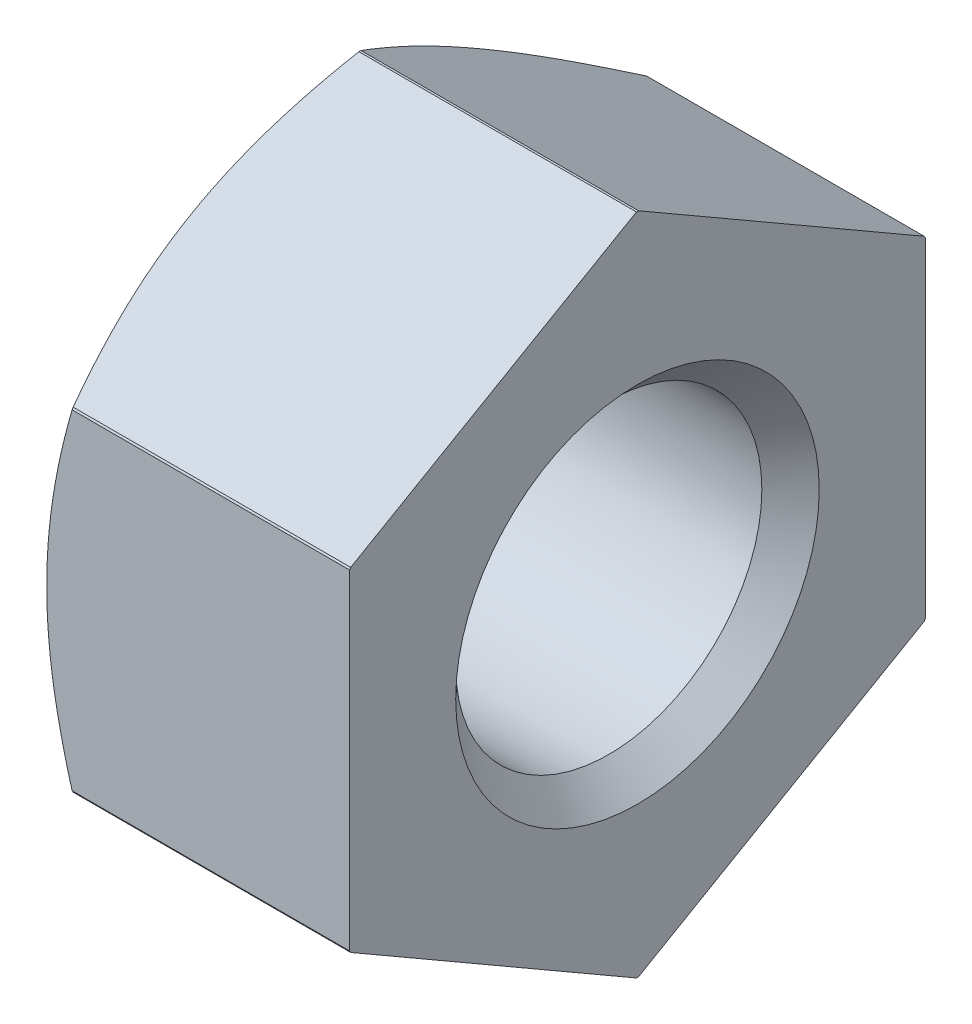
ISO-10303-21;
HEADER;
FILE_DESCRIPTION(('STEP AP214'),'2;1');
FILE_NAME('part.step','',(''),(''),'','','');
FILE_SCHEMA(('AUTOMOTIVE_DESIGN { 1 0 10303 214 1 1 1 1 }'));
ENDSEC;
DATA;
#1=APPLICATION_CONTEXT('core data for automotive mechanical design processes');
#2=APPLICATION_PROTOCOL_DEFINITION('international standard','automotive_design',2000,#1);
#3=PRODUCT_CONTEXT('',#1,'mechanical');
#4=PRODUCT('Part','Part','',(#3));
#5=PRODUCT_RELATED_PRODUCT_CATEGORY('part','',(#4));
#6=PRODUCT_DEFINITION_FORMATION('','',#4);
#7=PRODUCT_DEFINITION_CONTEXT('part definition',#1,'design');
#8=PRODUCT_DEFINITION('design','',#6,#7);
#9=PRODUCT_DEFINITION_SHAPE('','',#8);
#10=(LENGTH_UNIT() NAMED_UNIT(*) SI_UNIT(.MILLI.,.METRE.));
#11=(NAMED_UNIT(*) PLANE_ANGLE_UNIT() SI_UNIT($,.RADIAN.));
#12=(NAMED_UNIT(*) SI_UNIT($,.STERADIAN.) SOLID_ANGLE_UNIT());
#13=UNCERTAINTY_MEASURE_WITH_UNIT(LENGTH_MEASURE(1.E-05),#10,'distance_accuracy_value','');
#14=(GEOMETRIC_REPRESENTATION_CONTEXT(3) GLOBAL_UNCERTAINTY_ASSIGNED_CONTEXT((#13)) GLOBAL_UNIT_ASSIGNED_CONTEXT((#10,
#11,#12)) REPRESENTATION_CONTEXT('',''));
#15=CARTESIAN_POINT('',(0.,0.,0.));
#16=DIRECTION('',(0.,0.,1.));
#17=DIRECTION('',(1.,0.,0.));
#18=AXIS2_PLACEMENT_3D('',#15,#16,#17);
#19=CARTESIAN_POINT('',(-5.,0.,0.));
#20=DIRECTION('',(1.,0.,0.));
#21=DIRECTION('',(0.,0.,-1.));
#22=AXIS2_PLACEMENT_3D('',#19,#20,#21);
#23=CONICAL_SURFACE('',#22,9.5,1.04719755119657);
#24=CARTESIAN_POINT('',(-4.162842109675,0.,0.));
#25=DIRECTION('',(1.,0.,0.));
#26=DIRECTION('',(0.,-0.497297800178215,0.867579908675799));
#27=AXIS2_PLACEMENT_3D('',#24,#25,#26);
#28=CIRCLE('',#27,10.95);
#29=CARTESIAN_POINT('',(-4.162842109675,-5.44541091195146,9.5));
#30=VERTEX_POINT('',#29);
#31=CARTESIAN_POINT('',(-4.162842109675,-5.50453587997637,9.46586418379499));
#32=VERTEX_POINT('',#31);
#33=EDGE_CURVE('E142',#30,#32,#28,.T.);
#34=ORIENTED_EDGE('',*,*,#33,.F.);
#35=CARTESIAN_POINT('',(-4.16284213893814,-5.44541081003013,9.5));
#36=CARTESIAN_POINT('',(-4.18596577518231,-5.36487289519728,9.49999883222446));
#37=CARTESIAN_POINT('',(-4.20879017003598,-5.2842485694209,9.4998760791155));
#38=CARTESIAN_POINT('',(-4.25316373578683,-5.12496818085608,9.49949176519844));
#39=CARTESIAN_POINT('',(-4.27473068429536,-5.04631705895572,9.49923399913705));
#40=CARTESIAN_POINT('',(-4.31664848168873,-4.8907049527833,9.49868016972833));
#41=CARTESIAN_POINT('',(-4.33701607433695,-4.81374848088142,9.49838516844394));
#42=CARTESIAN_POINT('',(-4.37659463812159,-4.66125217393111,9.49783123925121));
#43=CARTESIAN_POINT('',(-4.39582087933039,-4.58571630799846,9.49757168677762));
#44=CARTESIAN_POINT('',(-4.43317666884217,-4.43579213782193,9.49714034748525));
#45=CARTESIAN_POINT('',(-4.45131960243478,-4.36140717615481,9.49696708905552));
#46=CARTESIAN_POINT('',(-4.48656910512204,-4.21352050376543,9.49673778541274));
#47=CARTESIAN_POINT('',(-4.50368681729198,-4.14002145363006,9.49668009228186));
#48=CARTESIAN_POINT('',(-4.53694648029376,-3.99364721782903,9.49669030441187));
#49=CARTESIAN_POINT('',(-4.55309704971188,-3.92077399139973,9.49675684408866));
#50=CARTESIAN_POINT('',(-4.58448348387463,-3.77539720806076,9.49700307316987));
#51=CARTESIAN_POINT('',(-4.59972525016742,-3.70289492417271,9.49718191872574));
#52=CARTESIAN_POINT('',(-4.62935452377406,-3.55801112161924,9.49762188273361));
#53=CARTESIAN_POINT('',(-4.643745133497,-3.48563023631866,9.49788267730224));
#54=CARTESIAN_POINT('',(-4.67173540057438,-3.34074652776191,9.49843106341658));
#55=CARTESIAN_POINT('',(-4.68533537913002,-3.26824376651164,9.49871864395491));
#56=CARTESIAN_POINT('',(-4.71179711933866,-3.1228780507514,9.49926548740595));
#57=CARTESIAN_POINT('',(-4.72465653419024,-3.05001466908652,9.49952466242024));
#58=CARTESIAN_POINT('',(-4.74972904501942,-2.90370255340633,9.49986786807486));
#59=CARTESIAN_POINT('',(-4.76193754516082,-2.83025302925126,9.49995078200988));
#60=CARTESIAN_POINT('',(-4.78568517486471,-2.68231894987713,9.50004982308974));
#61=CARTESIAN_POINT('',(-4.79721422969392,-2.60783277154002,9.50006511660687));
#62=CARTESIAN_POINT('',(-4.81948652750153,-2.45777091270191,9.50015535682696));
#63=CARTESIAN_POINT('',(-4.8302178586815,-2.3821934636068,9.50023106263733));
#64=CARTESIAN_POINT('',(-4.85085016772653,-2.23031175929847,9.50033185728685));
#65=CARTESIAN_POINT('',(-4.8607438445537,-2.1540065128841,9.50035653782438));
#66=CARTESIAN_POINT('',(-4.87961619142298,-2.00101375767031,9.50035425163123));
#67=CARTESIAN_POINT('',(-4.88859156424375,-1.92432584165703,9.50032710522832));
#68=CARTESIAN_POINT('',(-4.90555463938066,-1.77090174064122,9.50023318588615));
#69=CARTESIAN_POINT('',(-4.91354311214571,-1.69416564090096,9.50016644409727));
#70=CARTESIAN_POINT('',(-4.92845316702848,-1.54096546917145,9.50005198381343));
#71=CARTESIAN_POINT('',(-4.935379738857,-1.46450188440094,9.50000417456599));
#72=CARTESIAN_POINT('',(-4.94815703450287,-1.31147715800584,9.49999582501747));
#73=CARTESIAN_POINT('',(-4.95400765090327,-1.2349160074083,9.50003529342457));
#74=CARTESIAN_POINT('',(-4.9646949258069,-1.08127475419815,9.50012040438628));
#75=CARTESIAN_POINT('',(-4.96952547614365,-1.00419422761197,9.50016608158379));
#76=CARTESIAN_POINT('',(-4.97814886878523,-0.849740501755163,9.50023144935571));
#77=CARTESIAN_POINT('',(-4.98193851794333,-0.772367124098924,9.50025106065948));
#78=CARTESIAN_POINT('',(-4.98845974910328,-0.617550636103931,9.5002510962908));
#79=CARTESIAN_POINT('',(-4.99119098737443,-0.540107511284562,9.50023150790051));
#80=CARTESIAN_POINT('',(-4.99557501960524,-0.385370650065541,9.50016453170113));
#81=CARTESIAN_POINT('',(-4.99723030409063,-0.308076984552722,9.50011720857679));
#82=CARTESIAN_POINT('',(-4.99943900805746,-0.153855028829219,9.50003729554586));
#83=CARTESIAN_POINT('',(-4.99999781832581,-0.0769268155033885,9.50000463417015));
#84=CARTESIAN_POINT('',(-4.99999999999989,1.86265402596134E-06,9.5));
#85=B_SPLINE_CURVE_WITH_KNOTS('',3,(#35,#36,#37,#38,#39,#40,#41,#42,#43,#44,#45,#46,#47,#48,#49,
#50,#51,#52,#53,#54,#55,#56,#57,#58,#59,#60,#61,#62,#63,#64,#65,#66,#67,#68,#69,#70,#71,#72,#73,
#74,#75,#76,#77,#78,#79,#80,#81,#82,#83,#84),.UNSPECIFIED.,.F.,.F.,(4,2,2,2,2,2,2,2,2,2,2,2,2,2,
2,2,2,2,2,2,2,2,2,2,4),(0.,0.251375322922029,0.49603707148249,0.734853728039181,
0.968684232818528,1.19837750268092,1.42477142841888,1.64869144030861,1.870948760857,
2.09233848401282,2.31363762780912,2.53560330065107,2.75897110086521,2.98508504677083,
3.21408581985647,3.44491206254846,3.67653998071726,3.90798591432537,4.13830858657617,
4.36865424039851,4.60034237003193,4.83273350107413,5.0652000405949,5.29712655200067,
5.52790991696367),.UNSPECIFIED.);
#86=CARTESIAN_POINT('',(-5.,0.,9.5));
#87=VERTEX_POINT('',#86);
#88=EDGE_CURVE('E126',#30,#87,#85,.T.);
#89=ORIENTED_EDGE('',*,*,#88,.T.);
#90=CARTESIAN_POINT('',(-5.,0.,0.));
#91=DIRECTION('',(1.,0.,0.));
#92=DIRECTION('',(0.,0.,1.));
#93=AXIS2_PLACEMENT_3D('',#90,#91,#92);
#94=CIRCLE('',#93,9.5);
#95=CARTESIAN_POINT('',(-5.,-8.22724133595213,4.75000000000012));
#96=VERTEX_POINT('',#95);
#97=EDGE_CURVE('E141',#87,#96,#94,.T.);
#98=ORIENTED_EDGE('',*,*,#97,.T.);
#99=CARTESIAN_POINT('',(-4.99999999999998,-8.22724149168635,4.74999973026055));
#100=CARTESIAN_POINT('',(-4.99997285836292,-8.18856711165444,4.81708162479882));
#101=CARTESIAN_POINT('',(-4.99943200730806,-8.14984146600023,4.88413483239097));
#102=CARTESIAN_POINT('',(-4.99727765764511,-8.07282220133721,5.01747008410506));
#103=CARTESIAN_POINT('',(-4.99567625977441,-8.03452860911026,5.08375234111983));
#104=CARTESIAN_POINT('',(-4.99137177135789,-7.95829049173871,5.21589389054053));
#105=CARTESIAN_POINT('',(-4.98867608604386,-7.92034533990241,5.28175306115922));
#106=CARTESIAN_POINT('',(-4.98219777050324,-7.84435213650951,5.41375445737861));
#107=CARTESIAN_POINT('',(-4.97841029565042,-7.80630439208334,5.47989662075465));
#108=CARTESIAN_POINT('',(-4.96977348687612,-7.73009989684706,5.61238145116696));
#109=CARTESIAN_POINT('',(-4.96492020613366,-7.69194327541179,5.67872393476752));
#110=CARTESIAN_POINT('',(-4.95417386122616,-7.6155307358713,5.8115301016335));
#111=CARTESIAN_POINT('',(-4.94827776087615,-7.57727485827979,5.87799356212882));
#112=CARTESIAN_POINT('',(-4.93546861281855,-7.50068384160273,6.01096262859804));
#113=CARTESIAN_POINT('',(-4.9285534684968,-7.46234870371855,6.07746803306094));
#114=CARTESIAN_POINT('',(-4.91372889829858,-7.38563140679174,6.21044307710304));
#115=CARTESIAN_POINT('',(-4.90581834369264,-7.34724924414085,6.27691258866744));
#116=CARTESIAN_POINT('',(-4.8890253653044,-7.27048291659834,6.40973930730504));
#117=CARTESIAN_POINT('',(-4.88014281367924,-7.23209875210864,6.47609649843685));
#118=CARTESIAN_POINT('',(-4.86142924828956,-7.15538444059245,6.60862262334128));
#119=CARTESIAN_POINT('',(-4.85159914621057,-7.11705427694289,6.67479167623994));
#120=CARTESIAN_POINT('',(-4.83100994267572,-7.04052374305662,6.80687026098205));
#121=CARTESIAN_POINT('',(-4.82025284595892,-7.00232326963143,6.87278004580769));
#122=CARTESIAN_POINT('',(-4.79784359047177,-6.9261164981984,7.004259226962));
#123=CARTESIAN_POINT('',(-4.78619454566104,-6.88810997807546,7.06982902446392));
#124=CARTESIAN_POINT('',(-4.76198166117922,-6.81246241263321,7.20058994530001));
#125=CARTESIAN_POINT('',(-4.74942236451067,-6.77482048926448,7.26578140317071));
#126=CARTESIAN_POINT('',(-4.72361638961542,-6.69985934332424,7.39537704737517));
#127=CARTESIAN_POINT('',(-4.71037723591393,-6.66254039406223,7.45978289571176));
#128=CARTESIAN_POINT('',(-4.68327881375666,-6.58818550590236,7.58779254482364));
#129=CARTESIAN_POINT('',(-4.66942654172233,-6.55115020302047,7.65139819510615));
#130=CARTESIAN_POINT('',(-4.64101418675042,-6.4773481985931,7.7781212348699));
#131=CARTESIAN_POINT('',(-4.62645842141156,-6.44058114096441,7.84123938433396));
#132=CARTESIAN_POINT('',(-4.59658139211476,-6.36722414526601,7.96727214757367));
#133=CARTESIAN_POINT('',(-4.58126124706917,-6.33063402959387,8.0301869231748));
#134=CARTESIAN_POINT('',(-4.54979018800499,-6.2575272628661,8.15609759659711));
#135=CARTESIAN_POINT('',(-4.53363707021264,-6.22101110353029,8.2190932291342));
#136=CARTESIAN_POINT('',(-4.50043696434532,-6.14791998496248,8.34544211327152));
#137=CARTESIAN_POINT('',(-4.483384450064,-6.11134644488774,8.40879473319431));
#138=CARTESIAN_POINT('',(-4.44832182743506,-6.03798449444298,8.53612766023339));
#139=CARTESIAN_POINT('',(-4.43030302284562,-6.00119838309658,8.60010689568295));
#140=CARTESIAN_POINT('',(-4.39324401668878,-5.92723033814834,8.72895578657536));
#141=CARTESIAN_POINT('',(-4.37419224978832,-5.89005120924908,8.79382372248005));
#142=CARTESIAN_POINT('',(-4.3350031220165,-5.81509125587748,8.92470502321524));
#143=CARTESIAN_POINT('',(-4.31485174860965,-5.77731305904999,8.99071569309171));
#144=CARTESIAN_POINT('',(-4.27339869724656,-5.70092441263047,9.12412937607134));
#145=CARTESIAN_POINT('',(-4.25208107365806,-5.66231546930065,9.19152829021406));
#146=CARTESIAN_POINT('',(-4.20823042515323,-5.58400649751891,9.32795546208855));
#147=CARTESIAN_POINT('',(-4.1856801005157,-5.54430560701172,9.3969776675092));
#148=CARTESIAN_POINT('',(-4.16284210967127,-5.50453587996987,9.46586418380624));
#149=B_SPLINE_CURVE_WITH_KNOTS('',3,(#99,#100,#101,#102,#103,#104,#105,#106,#107,#108,#109,#110,
#111,#112,#113,#114,#115,#116,#117,#118,#119,#120,#121,#122,#123,#124,#125,#126,#127,#128,#129,
#130,#131,#132,#133,#134,#135,#136,#137,#138,#139,#140,#141,#142,#143,#144,#145,#146,#147,#148),
.UNSPECIFIED.,.F.,.F.,(4,2,2,2,2,2,2,2,2,2,2,2,2,2,2,2,2,2,2,2,2,2,2,2,4),(0.,0.232295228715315,
0.461984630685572,0.690144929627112,0.919333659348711,1.14938586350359,1.38011923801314,
1.61133413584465,1.84281361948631,2.07432358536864,2.30561298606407,2.53641417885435,
2.76644343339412,2.99539466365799,3.22220531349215,3.44688458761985,3.67032666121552,
3.89345073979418,4.11719888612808,4.34253362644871,4.57043552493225,4.80190094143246,
5.03794018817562,5.27957627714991,5.52784440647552),.UNSPECIFIED.);
#150=EDGE_CURVE('E155',#96,#32,#149,.T.);
#151=ORIENTED_EDGE('',*,*,#150,.T.);
#152=EDGE_LOOP('',(#34,#89,#98,#151));
#153=FACE_BOUND('',#152,.T.);
#154=ADVANCED_FACE('F17',(#153),#23,.T.);
#155=CARTESIAN_POINT('',(5.,0.,0.));
#156=DIRECTION('',(1.,0.,0.));
#157=DIRECTION('',(0.,0.,-1.));
#158=AXIS2_PLACEMENT_3D('',#155,#156,#157);
#159=CYLINDRICAL_SURFACE('',#158,10.95);
#160=CARTESIAN_POINT('',(5.,0.,0.));
#161=DIRECTION('',(1.,0.,0.));
#162=DIRECTION('',(0.,-0.497297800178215,0.867579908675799));
#163=AXIS2_PLACEMENT_3D('',#160,#161,#162);
#164=CIRCLE('',#163,10.95);
#165=CARTESIAN_POINT('',(5.,-5.44541091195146,9.5));
#166=VERTEX_POINT('',#165);
#167=CARTESIAN_POINT('',(5.,-5.50453587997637,9.46586418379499));
#168=VERTEX_POINT('',#167);
#169=EDGE_CURVE('E150',#166,#168,#164,.T.);
#170=ORIENTED_EDGE('',*,*,#169,.F.);
#171=DIRECTION('',(-1.,0.,0.));
#172=VECTOR('',#171,1.);
#173=CARTESIAN_POINT('',(5.,-5.44541091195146,9.5));
#174=LINE('',#173,#172);
#175=EDGE_CURVE('E131',#166,#30,#174,.T.);
#176=ORIENTED_EDGE('',*,*,#175,.T.);
#177=ORIENTED_EDGE('',*,*,#33,.T.);
#178=DIRECTION('',(1.,0.,0.));
#179=VECTOR('',#178,1.);
#180=CARTESIAN_POINT('',(-4.162842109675,-5.50453587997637,9.46586418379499));
#181=LINE('',#180,#179);
#182=EDGE_CURVE('E151',#32,#168,#181,.T.);
#183=ORIENTED_EDGE('',*,*,#182,.T.);
#184=EDGE_LOOP('',(#170,#176,#177,#183));
#185=FACE_BOUND('',#184,.T.);
#186=ADVANCED_FACE('F148',(#185),#159,.T.);
#187=CARTESIAN_POINT('',(5.,5.4848275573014,9.5));
#188=DIRECTION('',(0.,0.,-1.));
#189=DIRECTION('',(-1.,0.,0.));
#190=AXIS2_PLACEMENT_3D('',#187,#188,#189);
#191=PLANE('',#190);
#192=CARTESIAN_POINT('',(-4.99999999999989,1.86265402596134E-06,9.5));
#193=CARTESIAN_POINT('',(-4.99999963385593,0.025923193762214,9.50000064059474));
#194=CARTESIAN_POINT('',(-4.99993871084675,0.0518445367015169,9.50000005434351));
#195=CARTESIAN_POINT('',(-4.99969442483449,0.103509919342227,9.50000025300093));
#196=CARTESIAN_POINT('',(-4.99951189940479,0.129253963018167,9.50000102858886));
#197=CARTESIAN_POINT('',(-4.99902302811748,0.180751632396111,9.50000768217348));
#198=CARTESIAN_POINT('',(-4.99871663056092,0.206505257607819,9.50001356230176));
#199=CARTESIAN_POINT('',(-4.99798147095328,0.258032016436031,9.50002754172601));
#200=CARTESIAN_POINT('',(-4.99755260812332,0.283805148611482,9.50003564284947));
#201=CARTESIAN_POINT('',(-4.99657300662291,0.335366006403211,9.50005305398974));
#202=CARTESIAN_POINT('',(-4.99602218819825,0.361153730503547,9.50006236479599));
#203=CARTESIAN_POINT('',(-4.99479942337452,0.412738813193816,9.50008093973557));
#204=CARTESIAN_POINT('',(-4.99412741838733,0.438536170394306,9.5000902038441));
#205=CARTESIAN_POINT('',(-4.99266295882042,0.490135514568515,9.50010775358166));
#206=CARTESIAN_POINT('',(-4.99187046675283,0.515937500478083,9.50011603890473));
#207=CARTESIAN_POINT('',(-4.99016573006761,0.567541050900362,9.50013087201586));
#208=CARTESIAN_POINT('',(-4.98925346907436,0.593342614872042,9.50013741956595));
#209=CARTESIAN_POINT('',(-4.98730988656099,0.644940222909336,9.50014823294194));
#210=CARTESIAN_POINT('',(-4.98627856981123,0.670736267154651,9.50015249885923));
#211=CARTESIAN_POINT('',(-4.98409756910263,0.722317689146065,9.50015840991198));
#212=CARTESIAN_POINT('',(-4.98294791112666,0.748103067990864,9.50016005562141));
#213=CARTESIAN_POINT('',(-4.98053092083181,0.799657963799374,9.50016059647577));
#214=CARTESIAN_POINT('',(-4.97926363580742,0.825427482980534,9.5001594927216));
#215=CARTESIAN_POINT('',(-4.97661208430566,0.876945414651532,9.50015461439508));
#216=CARTESIAN_POINT('',(-4.97522788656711,0.902693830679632,9.50015084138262));
#217=CARTESIAN_POINT('',(-4.97234320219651,0.954164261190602,9.50014091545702));
#218=CARTESIAN_POINT('',(-4.9708428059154,0.979886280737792,9.50013476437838));
#219=CARTESIAN_POINT('',(-4.96772641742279,1.03129857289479,9.50012058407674));
#220=CARTESIAN_POINT('',(-4.96611053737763,1.05698885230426,9.50011255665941));
#221=CARTESIAN_POINT('',(-4.96276387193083,1.10833226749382,9.50009534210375));
#222=CARTESIAN_POINT('',(-4.9610332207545,1.13398541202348,9.50008615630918));
#223=CARTESIAN_POINT('',(-4.95745771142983,1.18524910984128,9.5000675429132));
#224=CARTESIAN_POINT('',(-4.95561300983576,1.21085967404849,9.50005811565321));
#225=CARTESIAN_POINT('',(-4.95181006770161,1.2620327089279,9.50004020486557));
#226=CARTESIAN_POINT('',(-4.94985200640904,1.28759519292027,9.50003171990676));
#227=CARTESIAN_POINT('',(-4.94582312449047,1.3386665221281,9.50001689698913));
#228=CARTESIAN_POINT('',(-4.94375250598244,1.36417538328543,9.50001055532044));
#229=CARTESIAN_POINT('',(-4.93949885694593,1.41513401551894,9.50000217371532));
#230=CARTESIAN_POINT('',(-4.9373160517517,1.4405838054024,9.50000012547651));
#231=CARTESIAN_POINT('',(-4.93283652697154,1.49145778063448,9.4999999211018));
#232=CARTESIAN_POINT('',(-4.93053987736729,1.51688197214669,9.50000176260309));
#233=CARTESIAN_POINT('',(-4.92583226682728,1.56773139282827,9.50000706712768));
#234=CARTESIAN_POINT('',(-4.92342125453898,1.59315661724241,9.50001053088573));
#235=CARTESIAN_POINT('',(-4.91848577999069,1.64400618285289,9.50001865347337));
#236=CARTESIAN_POINT('',(-4.91596127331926,1.66943051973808,9.50002331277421));
#237=CARTESIAN_POINT('',(-4.91079993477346,1.72027633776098,9.50003303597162));
#238=CARTESIAN_POINT('',(-4.90816306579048,1.74569781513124,9.50003810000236));
#239=CARTESIAN_POINT('',(-4.90277805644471,1.79653586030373,9.50004807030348));
#240=CARTESIAN_POINT('',(-4.90002988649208,1.82195242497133,9.50005297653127));
#241=CARTESIAN_POINT('',(-4.894423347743,1.87277851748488,9.50006214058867));
#242=CARTESIAN_POINT('',(-4.89156495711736,1.89818804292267,9.50006639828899));
#243=CARTESIAN_POINT('',(-4.88573904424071,1.94899785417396,9.50007389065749));
#244=CARTESIAN_POINT('',(-4.88277150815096,1.97439813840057,9.50007712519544));
#245=CARTESIAN_POINT('',(-4.87672837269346,2.02518718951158,9.50008230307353));
#246=CARTESIAN_POINT('',(-4.87365276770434,2.05057595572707,9.50008424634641));
#247=CARTESIAN_POINT('',(-4.86739456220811,2.10133961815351,9.50008668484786));
#248=CARTESIAN_POINT('',(-4.86421196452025,2.12671451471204,9.50008718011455));
#249=CARTESIAN_POINT('',(-4.85774084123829,2.1774480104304,9.50008667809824));
#250=CARTESIAN_POINT('',(-4.85445232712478,2.20280661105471,9.50008568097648));
#251=CARTESIAN_POINT('',(-4.84777043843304,2.25350501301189,9.50008226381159));
#252=CARTESIAN_POINT('',(-4.84437708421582,2.27884481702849,9.50007984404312));
#253=CARTESIAN_POINT('',(-4.83748658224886,2.32950304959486,9.50007376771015));
#254=CARTESIAN_POINT('',(-4.8339894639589,2.35482148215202,9.50007011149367));
#255=CARTESIAN_POINT('',(-4.82689250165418,2.4054343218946,9.50006186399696));
#256=CARTESIAN_POINT('',(-4.82329269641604,2.43072873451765,9.50005727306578));
#257=CARTESIAN_POINT('',(-4.81599142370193,2.48129081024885,9.50004758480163));
#258=CARTESIAN_POINT('',(-4.8122900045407,2.50655848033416,9.50004248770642));
#259=CARTESIAN_POINT('',(-4.80478658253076,2.55706427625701,9.5000323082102));
#260=CARTESIAN_POINT('',(-4.80098463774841,2.58230241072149,9.50002722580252));
#261=CARTESIAN_POINT('',(-4.79328118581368,2.63274625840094,9.50001782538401));
#262=CARTESIAN_POINT('',(-4.78937974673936,2.65795198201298,9.50001350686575));
#263=CARTESIAN_POINT('',(-4.78147853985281,2.70832809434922,9.5000061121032));
#264=CARTESIAN_POINT('',(-4.77747885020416,2.73349849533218,9.5000030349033));
#265=CARTESIAN_POINT('',(-4.76938158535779,2.78380083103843,9.50000020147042));
#266=CARTESIAN_POINT('',(-4.76528409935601,2.80893278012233,9.50000044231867));
#267=CARTESIAN_POINT('',(-4.75699567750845,2.85915811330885,9.49999829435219));
#268=CARTESIAN_POINT('',(-4.7528048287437,2.88425151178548,9.49999590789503));
#269=CARTESIAN_POINT('',(-4.74432956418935,2.93440396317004,9.49998944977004));
#270=CARTESIAN_POINT('',(-4.74004521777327,2.9594630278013,9.49998537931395));
#271=CARTESIAN_POINT('',(-4.73138277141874,3.00955155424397,9.49997635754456));
#272=CARTESIAN_POINT('',(-4.72700472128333,3.03458102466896,9.49997140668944));
#273=CARTESIAN_POINT('',(-4.71815467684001,3.08461509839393,9.49996131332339));
#274=CARTESIAN_POINT('',(-4.71368271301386,3.10961970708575,9.49995617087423));
#275=CARTESIAN_POINT('',(-4.70464465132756,3.15960878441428,9.49994626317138));
#276=CARTESIAN_POINT('',(-4.70007856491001,3.18459325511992,9.49994149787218));
#277=CARTESIAN_POINT('',(-4.69085206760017,3.23454677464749,9.49993279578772));
#278=CARTESIAN_POINT('',(-4.68619164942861,3.25951582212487,9.49992885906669));
#279=CARTESIAN_POINT('',(-4.67677629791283,3.3094432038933,9.49992214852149));
#280=CARTESIAN_POINT('',(-4.67202133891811,3.33440153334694,9.49991937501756));
#281=CARTESIAN_POINT('',(-4.6624167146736,3.38431217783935,9.499915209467));
#282=CARTESIAN_POINT('',(-4.65756700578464,3.40926448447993,9.49991381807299));
#283=CARTESIAN_POINT('',(-4.64777269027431,3.45916777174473,9.49991252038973));
#284=CARTESIAN_POINT('',(-4.64282802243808,3.48411874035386,9.49991261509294));
#285=CARTESIAN_POINT('',(-4.63284359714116,3.53402402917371,9.49991427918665));
#286=CARTESIAN_POINT('',(-4.62780376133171,3.55897833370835,9.4999158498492));
#287=CARTESIAN_POINT('',(-4.61762880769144,3.60889496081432,9.49992034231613));
#288=CARTESIAN_POINT('',(-4.61249359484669,3.63385726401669,9.49992326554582));
#289=CARTESIAN_POINT('',(-4.60212769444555,3.68379454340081,9.49993022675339));
#290=CARTESIAN_POINT('',(-4.59689689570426,3.70876949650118,9.49993426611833));
#291=CARTESIAN_POINT('',(-4.58633962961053,3.75873671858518,9.49994311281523));
#292=CARTESIAN_POINT('',(-4.58101303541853,3.78372896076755,9.49994792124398));
#293=CARTESIAN_POINT('',(-4.5702639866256,3.83373539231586,9.4999578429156));
#294=CARTESIAN_POINT('',(-4.56484139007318,3.85874955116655,9.499962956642));
#295=CARTESIAN_POINT('',(-4.55390013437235,3.90880443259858,9.4999729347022));
#296=CARTESIAN_POINT('',(-4.54838131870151,3.93384512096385,9.4999777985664));
#297=CARTESIAN_POINT('',(-4.53724745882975,3.98395767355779,9.49998653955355));
#298=CARTESIAN_POINT('',(-4.53163224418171,4.00902949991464,9.49999041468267));
#299=CARTESIAN_POINT('',(-4.52030528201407,4.05920889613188,9.49999660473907));
#300=CARTESIAN_POINT('',(-4.51459335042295,4.08431642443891,9.49999891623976));
#301=CARTESIAN_POINT('',(-4.50308451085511,4.13452240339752,9.50000027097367));
#302=CARTESIAN_POINT('',(-4.49728757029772,4.15962084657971,9.49999931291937));
#303=CARTESIAN_POINT('',(-4.48564044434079,4.20967844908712,9.49999302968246));
#304=CARTESIAN_POINT('',(-4.47979064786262,4.23463769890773,9.4999877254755));
#305=CARTESIAN_POINT('',(-4.46803281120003,4.28443799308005,9.49997696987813));
#306=CARTESIAN_POINT('',(-4.46212509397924,4.3092791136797,9.4999715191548));
#307=CARTESIAN_POINT('',(-4.45024477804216,4.35887498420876,9.499962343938));
#308=CARTESIAN_POINT('',(-4.44427239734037,4.38362978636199,9.49995861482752));
#309=CARTESIAN_POINT('',(-4.4322559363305,4.43308509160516,9.4999541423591));
#310=CARTESIAN_POINT('',(-4.42621196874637,4.4577856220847,9.49995339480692));
#311=CARTESIAN_POINT('',(-4.41404556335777,4.50716473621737,9.49995508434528));
#312=CARTESIAN_POINT('',(-4.40792313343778,4.53184332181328,9.49995752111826));
#313=CARTESIAN_POINT('',(-4.39559302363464,4.58121115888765,9.49996483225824));
#314=CARTESIAN_POINT('',(-4.38938524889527,4.60590038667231,9.49996970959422));
#315=CARTESIAN_POINT('',(-4.37687765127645,4.6553223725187,9.49998022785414));
#316=CARTESIAN_POINT('',(-4.37057763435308,4.68005508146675,9.49998587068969));
#317=CARTESIAN_POINT('',(-4.35787882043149,4.72959716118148,9.49999514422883));
#318=CARTESIAN_POINT('',(-4.35147973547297,4.75440645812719,9.49999876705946));
#319=CARTESIAN_POINT('',(-4.338601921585,4.80403428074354,9.50000079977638));
#320=CARTESIAN_POINT('',(-4.33212311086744,4.82885278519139,9.4999992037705));
#321=CARTESIAN_POINT('',(-4.31911695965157,4.8783722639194,9.49999630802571));
#322=CARTESIAN_POINT('',(-4.31258991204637,4.90307331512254,9.49999500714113));
#323=CARTESIAN_POINT('',(-4.29947195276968,4.95242031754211,9.49999388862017));
#324=CARTESIAN_POINT('',(-4.29288114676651,4.97706629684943,9.49999406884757));
#325=CARTESIAN_POINT('',(-4.27961900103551,5.02636958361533,9.49999604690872));
#326=CARTESIAN_POINT('',(-4.27294757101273,5.05102686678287,9.49999784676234));
#327=CARTESIAN_POINT('',(-4.25951507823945,5.10039476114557,9.49999973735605));
#328=CARTESIAN_POINT('',(-4.25275380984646,5.1251053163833,9.49999982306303));
#329=CARTESIAN_POINT('',(-4.23917470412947,5.17445798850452,9.49999962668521));
#330=CARTESIAN_POINT('',(-4.23235700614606,5.19910014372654,9.49999934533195));
#331=CARTESIAN_POINT('',(-4.21864515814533,5.24839051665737,9.49999944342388));
#332=CARTESIAN_POINT('',(-4.21175093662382,5.27303871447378,9.49999982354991));
#333=CARTESIAN_POINT('',(-4.19789514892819,5.32231319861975,9.50000013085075));
#334=CARTESIAN_POINT('',(-4.19093359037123,5.34693948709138,9.50000005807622));
#335=CARTESIAN_POINT('',(-4.17693954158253,5.39618522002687,9.49999991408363));
#336=CARTESIAN_POINT('',(-4.16990701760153,5.42080465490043,9.49999984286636));
#337=CARTESIAN_POINT('',(-4.16284108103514,5.44541449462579,9.5));
#338=B_SPLINE_CURVE_WITH_KNOTS('',3,(#192,#193,#194,#195,#196,#197,#198,#199,#200,#201,#202,
#203,#204,#205,#206,#207,#208,#209,#210,#211,#212,#213,#214,#215,#216,#217,#218,#219,#220,#221,
#222,#223,#224,#225,#226,#227,#228,#229,#230,#231,#232,#233,#234,#235,#236,#237,#238,#239,#240,
#241,#242,#243,#244,#245,#246,#247,#248,#249,#250,#251,#252,#253,#254,#255,#256,#257,#258,#259,
#260,#261,#262,#263,#264,#265,#266,#267,#268,#269,#270,#271,#272,#273,#274,#275,#276,#277,#278,
#279,#280,#281,#282,#283,#284,#285,#286,#287,#288,#289,#290,#291,#292,#293,#294,#295,#296,#297,
#298,#299,#300,#301,#302,#303,#304,#305,#306,#307,#308,#309,#310,#311,#312,#313,#314,#315,#316,
#317,#318,#319,#320,#321,#322,#323,#324,#325,#326,#327,#328,#329,#330,#331,#332,#333,#334,#335,
#336,#337),.UNSPECIFIED.,.F.,.F.,(4,2,2,2,2,2,2,2,2,2,2,2,2,2,2,2,2,2,2,2,2,2,2,2,2,2,2,2,2,2,2,
2,2,2,2,2,2,2,2,2,2,2,2,2,2,2,2,2,2,2,2,2,2,2,2,2,2,2,2,2,2,2,2,2,2,2,2,2,2,2,2,2,4),(0.,
0.0777639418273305,0.154997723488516,0.232263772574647,0.309593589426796,0.386974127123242,
0.464392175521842,0.54183436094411,0.619287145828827,0.696736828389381,0.77416954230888,
0.851571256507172,0.928927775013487,1.00622473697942,1.08344761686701,1.1605817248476,
1.23761220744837,1.31452404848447,1.39130207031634,1.46793148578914,1.5445143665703,
1.62113196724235,1.69777981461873,1.77445317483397,1.85114705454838,1.92785620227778,
2.00457510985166,2.08129801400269,2.1580188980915,2.23473149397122,2.31142928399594,
2.38810550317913,2.46475314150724,2.54136494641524,2.61793342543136,2.69445084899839,
2.77090925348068,2.84730040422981,2.92362306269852,2.99989089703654,3.07611915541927,
3.15232304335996,3.22851772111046,3.30471830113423,3.38093984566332,3.45719736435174,
3.53350581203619,3.60988008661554,3.68633502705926,3.76288541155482,3.83954595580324,
3.91633131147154,3.99325606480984,4.07033473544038,4.14758177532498,4.22485923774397,
4.30176592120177,4.37836762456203,4.45476268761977,4.53105024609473,4.60733019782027,
4.68370317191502,4.76027050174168,4.8371342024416,4.91408471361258,4.99073118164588,
5.06726712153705,5.14389864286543,5.22075513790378,5.2974586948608,5.37424124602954,
5.45101521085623,5.52782759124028),.UNSPECIFIED.);
#339=CARTESIAN_POINT('',(-4.162842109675,5.44541091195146,9.5));
#340=VERTEX_POINT('',#339);
#341=EDGE_CURVE('E134',#87,#340,#338,.T.);
#342=ORIENTED_EDGE('',*,*,#341,.F.);
#343=ORIENTED_EDGE('',*,*,#88,.F.);
#344=ORIENTED_EDGE('',*,*,#175,.F.);
#345=DIRECTION('',(0.,-1.,0.));
#346=VECTOR('',#345,1.);
#347=CARTESIAN_POINT('',(5.,5.44541091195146,9.5));
#348=LINE('',#347,#346);
#349=CARTESIAN_POINT('',(5.,5.44541091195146,9.5));
#350=VERTEX_POINT('',#349);
#351=EDGE_CURVE('E365',#350,#166,#348,.T.);
#352=ORIENTED_EDGE('',*,*,#351,.F.);
#353=DIRECTION('',(1.,0.,0.));
#354=VECTOR('',#353,1.);
#355=CARTESIAN_POINT('',(-4.162842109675,5.44541091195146,9.5));
#356=LINE('',#355,#354);
#357=EDGE_CURVE('E363',#340,#350,#356,.T.);
#358=ORIENTED_EDGE('',*,*,#357,.F.);
#359=EDGE_LOOP('',(#342,#343,#344,#352,#358));
#360=FACE_BOUND('',#359,.T.);
#361=ADVANCED_FACE('F129',(#360),#191,.F.);
#362=CARTESIAN_POINT('',(-5.,0.,0.));
#363=DIRECTION('',(1.,0.,0.));
#364=DIRECTION('',(0.,0.,-1.));
#365=AXIS2_PLACEMENT_3D('',#362,#363,#364);
#366=PLANE('',#365);
#367=CARTESIAN_POINT('',(-5.,0.,0.));
#368=DIRECTION('',(1.,0.,0.));
#369=DIRECTION('',(0.,0.,-1.));
#370=AXIS2_PLACEMENT_3D('',#367,#368,#369);
#371=CIRCLE('',#370,6.);
#372=CARTESIAN_POINT('',(-5.,0.,-6.));
#373=VERTEX_POINT('',#372);
#374=EDGE_CURVE('E364',#373,#373,#371,.T.);
#375=ORIENTED_EDGE('',*,*,#374,.T.);
#376=EDGE_LOOP('',(#375));
#377=FACE_BOUND('',#376,.T.);
#378=CARTESIAN_POINT('',(-5.,0.,0.));
#379=DIRECTION('',(1.,0.,0.));
#380=DIRECTION('',(0.,0.,-1.));
#381=AXIS2_PLACEMENT_3D('',#378,#379,#380);
#382=CIRCLE('',#381,9.5);
#383=CARTESIAN_POINT('',(-5.,0.,-9.5));
#384=VERTEX_POINT('',#383);
#385=CARTESIAN_POINT('',(-5.,8.22724133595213,-4.75000000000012));
#386=VERTEX_POINT('',#385);
#387=EDGE_CURVE('E368',#384,#386,#382,.T.);
#388=ORIENTED_EDGE('',*,*,#387,.F.);
#389=CARTESIAN_POINT('',(-5.,0.,0.));
#390=DIRECTION('',(1.,0.,0.));
#391=DIRECTION('',(0.,-0.866025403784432,-0.500000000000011));
#392=AXIS2_PLACEMENT_3D('',#389,#390,#391);
#393=CIRCLE('',#392,9.5);
#394=CARTESIAN_POINT('',(-5.,-8.22724133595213,-4.75000000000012));
#395=VERTEX_POINT('',#394);
#396=EDGE_CURVE('E377',#395,#384,#393,.T.);
#397=ORIENTED_EDGE('',*,*,#396,.F.);
#398=CARTESIAN_POINT('',(-5.,0.,0.));
#399=DIRECTION('',(1.,0.,0.));
#400=DIRECTION('',(0.,-0.866025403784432,0.500000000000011));
#401=AXIS2_PLACEMENT_3D('',#398,#399,#400);
#402=CIRCLE('',#401,9.5);
#403=EDGE_CURVE('E262',#96,#395,#402,.T.);
#404=ORIENTED_EDGE('',*,*,#403,.F.);
#405=ORIENTED_EDGE('',*,*,#97,.F.);
#406=CARTESIAN_POINT('',(-5.,0.,0.));
#407=DIRECTION('',(1.,0.,0.));
#408=DIRECTION('',(0.,0.866025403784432,0.500000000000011));
#409=AXIS2_PLACEMENT_3D('',#406,#407,#408);
#410=CIRCLE('',#409,9.5);
#411=CARTESIAN_POINT('',(-5.,8.22724133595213,4.75000000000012));
#412=VERTEX_POINT('',#411);
#413=EDGE_CURVE('E251',#412,#87,#410,.T.);
#414=ORIENTED_EDGE('',*,*,#413,.F.);
#415=CARTESIAN_POINT('',(-5.,0.,0.));
#416=DIRECTION('',(1.,0.,0.));
#417=DIRECTION('',(0.,0.866025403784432,-0.500000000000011));
#418=AXIS2_PLACEMENT_3D('',#415,#416,#417);
#419=CIRCLE('',#418,9.5);
#420=EDGE_CURVE('E259',#386,#412,#419,.T.);
#421=ORIENTED_EDGE('',*,*,#420,.F.);
#422=EDGE_LOOP('',(#388,#397,#404,#405,#414,#421));
#423=FACE_BOUND('',#422,.T.);
#424=ADVANCED_FACE('F258',(#377,#423),#366,.F.);
#425=CARTESIAN_POINT('',(5.,-5.4848275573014,9.5));
#426=DIRECTION('',(0.,0.866025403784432,-0.500000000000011));
#427=DIRECTION('',(0.,0.500000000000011,0.866025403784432));
#428=AXIS2_PLACEMENT_3D('',#425,#426,#427);
#429=PLANE('',#428);
#430=ORIENTED_EDGE('',*,*,#150,.F.);
#431=CARTESIAN_POINT('',(-4.16284210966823,-10.9499467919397,0.0341358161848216));
#432=CARTESIAN_POINT('',(-4.18602918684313,-10.909566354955,0.104074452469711));
#433=CARTESIAN_POINT('',(-4.20891397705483,-10.8690389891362,0.174029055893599));
#434=CARTESIAN_POINT('',(-4.2534048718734,-10.7888462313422,0.312172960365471));
#435=CARTESIAN_POINT('',(-4.27502879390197,-10.7491865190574,0.380359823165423));
#436=CARTESIAN_POINT('',(-4.31705639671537,-10.6706778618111,0.515254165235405));
#437=CARTESIAN_POINT('',(-4.33747686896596,-10.6318320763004,0.581958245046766));
#438=CARTESIAN_POINT('',(-4.37715636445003,-10.5548801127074,0.714156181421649));
#439=CARTESIAN_POINT('',(-4.39643072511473,-10.5167753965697,0.779646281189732));
#440=CARTESIAN_POINT('',(-4.43387722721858,-10.441217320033,0.909670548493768));
#441=CARTESIAN_POINT('',(-4.45206285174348,-10.4037643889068,0.974201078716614));
#442=CARTESIAN_POINT('',(-4.487391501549,-10.3294050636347,1.10254553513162));
#443=CARTESIAN_POINT('',(-4.50454580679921,-10.2924986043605,1.16635631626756));
#444=CARTESIAN_POINT('',(-4.53787170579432,-10.2191119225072,1.29348607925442));
#445=CARTESIAN_POINT('',(-4.55405209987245,-10.1826315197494,1.35680264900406));
#446=CARTESIAN_POINT('',(-4.58549051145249,-10.1099614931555,1.48315414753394));
#447=CARTESIAN_POINT('',(-4.60075465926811,-10.0737717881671,1.54618750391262));
#448=CARTESIAN_POINT('',(-4.63042030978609,-10.0015346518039,1.67216918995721));
#449=CARTESIAN_POINT('',(-4.64482518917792,-9.96548726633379,1.73511675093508));
#450=CARTESIAN_POINT('',(-4.67283486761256,-9.89336838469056,1.86110608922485));
#451=CARTESIAN_POINT('',(-4.68644030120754,-9.85729693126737,1.92414774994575));
#452=CARTESIAN_POINT('',(-4.71290321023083,-9.78496615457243,2.0505009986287));
#453=CARTESIAN_POINT('',(-4.72575868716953,-9.74870658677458,2.11381286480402));
#454=CARTESIAN_POINT('',(-4.75081249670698,-9.67576397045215,2.24082586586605));
#455=CARTESIAN_POINT('',(-4.76300658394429,-9.63907968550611,2.30452712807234));
#456=CARTESIAN_POINT('',(-4.78671567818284,-9.56515701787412,2.43276032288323));
#457=CARTESIAN_POINT('',(-4.79822101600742,-9.52791719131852,2.49729321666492));
#458=CARTESIAN_POINT('',(-4.82043923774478,-9.45296276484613,2.62729943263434));
#459=CARTESIAN_POINT('',(-4.8311406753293,-9.41524794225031,2.69277458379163));
#460=CARTESIAN_POINT('',(-4.85170780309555,-9.33942972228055,2.82429693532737));
#461=CARTESIAN_POINT('',(-4.86156663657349,-9.30132552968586,2.89034474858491));
#462=CARTESIAN_POINT('',(-4.8803656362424,-9.22489968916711,3.02271366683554));
#463=CARTESIAN_POINT('',(-4.88930295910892,-9.18657773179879,3.08903499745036));
#464=CARTESIAN_POINT('',(-4.90618803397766,-9.10989361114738,3.22166764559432));
#465=CARTESIAN_POINT('',(-4.91413701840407,-9.07153155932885,3.28797887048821));
#466=CARTESIAN_POINT('',(-4.9289673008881,-8.99497912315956,3.42034355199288));
#467=CARTESIAN_POINT('',(-4.93585407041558,-8.95678891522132,3.48639649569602));
#468=CARTESIAN_POINT('',(-4.9485531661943,-8.88045923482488,3.61858344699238));
#469=CARTESIAN_POINT('',(-4.95436611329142,-8.84231974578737,3.68471738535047));
#470=CARTESIAN_POINT('',(-4.96498073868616,-8.76581281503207,3.81738938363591));
#471=CARTESIAN_POINT('',(-4.96977707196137,-8.72744520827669,3.88392777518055));
#472=CARTESIAN_POINT('',(-4.97833609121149,-8.65056100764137,4.01721524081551));
#473=CARTESIAN_POINT('',(-4.98209607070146,-8.61204428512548,4.08396441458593));
#474=CARTESIAN_POINT('',(-4.98856408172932,-8.53495301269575,4.21749053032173));
#475=CARTESIAN_POINT('',(-4.9912719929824,-8.49637845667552,4.28426747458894));
#476=CARTESIAN_POINT('',(-4.99561727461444,-8.41928092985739,4.4176808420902));
#477=CARTESIAN_POINT('',(-4.99725709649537,-8.38075804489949,4.48431723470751));
#478=CARTESIAN_POINT('',(-4.99944492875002,-8.30389656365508,4.61729796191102));
#479=CARTESIAN_POINT('',(-4.99999801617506,-8.2655579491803,4.68364220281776));
#480=CARTESIAN_POINT('',(-4.99999999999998,-8.22724149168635,4.74999973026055));
#481=B_SPLINE_CURVE_WITH_KNOTS('',3,(#431,#432,#433,#434,#435,#436,#437,#438,#439,#440,#441,
#442,#443,#444,#445,#446,#447,#448,#449,#450,#451,#452,#453,#454,#455,#456,#457,#458,#459,#460,
#461,#462,#463,#464,#465,#466,#467,#468,#469,#470,#471,#472,#473,#474,#475,#476,#477,#478,#479,
#480),.UNSPECIFIED.,.F.,.F.,(4,2,2,2,2,2,2,2,2,2,2,2,2,2,2,2,2,2,2,2,2,2,2,2,4),(0.,
0.25206492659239,0.497438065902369,0.73697340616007,0.971515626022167,1.20189958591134,
1.42894931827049,1.65347660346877,1.87627924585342,2.09813918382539,2.31982057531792,
2.54206799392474,2.76560485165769,2.99176975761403,3.22070776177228,3.4513597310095,
3.68270332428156,3.91375548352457,4.14357460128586,4.37326042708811,4.60412544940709,
4.83558779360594,5.06707659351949,5.29803218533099,5.52790619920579),.UNSPECIFIED.);
#482=CARTESIAN_POINT('',(-4.162842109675,-10.9499467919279,0.0341358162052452));
#483=VERTEX_POINT('',#482);
#484=EDGE_CURVE('E269',#483,#96,#481,.T.);
#485=ORIENTED_EDGE('',*,*,#484,.F.);
#486=DIRECTION('',(-1.,0.,0.));
#487=VECTOR('',#486,1.);
#488=CARTESIAN_POINT('',(5.,-10.9499467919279,0.0341358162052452));
#489=LINE('',#488,#487);
#490=CARTESIAN_POINT('',(5.,-10.9499467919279,0.0341358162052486));
#491=VERTEX_POINT('',#490);
#492=EDGE_CURVE('E271',#491,#483,#489,.T.);
#493=ORIENTED_EDGE('',*,*,#492,.F.);
#494=DIRECTION('',(0.,-0.500000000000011,-0.866025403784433));
#495=VECTOR('',#494,1.);
#496=CARTESIAN_POINT('',(5.,-5.50453587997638,9.46586418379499));
#497=LINE('',#496,#495);
#498=EDGE_CURVE('E307',#168,#491,#497,.T.);
#499=ORIENTED_EDGE('',*,*,#498,.F.);
#500=ORIENTED_EDGE('',*,*,#182,.F.);
#501=EDGE_LOOP('',(#430,#485,#493,#499,#500));
#502=FACE_BOUND('',#501,.T.);
#503=ADVANCED_FACE('F285',(#502),#429,.F.);
#504=CARTESIAN_POINT('',(5.,10.95,0.));
#505=DIRECTION('',(-1.,0.,0.));
#506=DIRECTION('',(0.,0.,1.));
#507=AXIS2_PLACEMENT_3D('',#504,#505,#506);
#508=PLANE('',#507);
#509=CARTESIAN_POINT('',(5.,0.,0.));
#510=DIRECTION('',(1.,0.,0.));
#511=DIRECTION('',(0.,0.,-1.));
#512=AXIS2_PLACEMENT_3D('',#509,#510,#511);
#513=CIRCLE('',#512,6.);
#514=CARTESIAN_POINT('',(5.,0.,-6.));
#515=VERTEX_POINT('',#514);
#516=EDGE_CURVE('E312',#515,#515,#513,.T.);
#517=ORIENTED_EDGE('',*,*,#516,.F.);
#518=EDGE_LOOP('',(#517));
#519=FACE_BOUND('',#518,.T.);
#520=CARTESIAN_POINT('',(5.,0.,0.));
#521=DIRECTION('',(1.,0.,0.));
#522=DIRECTION('',(0.,0.502697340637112,0.864462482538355));
#523=AXIS2_PLACEMENT_3D('',#520,#521,#522);
#524=CIRCLE('',#523,10.95);
#525=CARTESIAN_POINT('',(5.,5.50453587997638,9.46586418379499));
#526=VERTEX_POINT('',#525);
#527=EDGE_CURVE('E317',#526,#350,#524,.T.);
#528=ORIENTED_EDGE('',*,*,#527,.T.);
#529=ORIENTED_EDGE('',*,*,#351,.T.);
#530=ORIENTED_EDGE('',*,*,#169,.T.);
#531=ORIENTED_EDGE('',*,*,#498,.T.);
#532=CARTESIAN_POINT('',(5.,0.,0.));
#533=DIRECTION('',(1.,0.,0.));
#534=DIRECTION('',(0.,-0.999995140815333,0.00311742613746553));
#535=AXIS2_PLACEMENT_3D('',#532,#533,#534);
#536=CIRCLE('',#535,10.95);
#537=CARTESIAN_POINT('',(5.,-10.9499467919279,-0.0341358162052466));
#538=VERTEX_POINT('',#537);
#539=EDGE_CURVE('E320',#491,#538,#536,.T.);
#540=ORIENTED_EDGE('',*,*,#539,.T.);
#541=DIRECTION('',(0.,0.500000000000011,-0.866025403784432));
#542=VECTOR('',#541,1.);
#543=CARTESIAN_POINT('',(5.,-10.9499467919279,-0.0341358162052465));
#544=LINE('',#543,#542);
#545=CARTESIAN_POINT('',(5.,-5.50453587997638,-9.46586418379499));
#546=VERTEX_POINT('',#545);
#547=EDGE_CURVE('E325',#538,#546,#544,.T.);
#548=ORIENTED_EDGE('',*,*,#547,.T.);
#549=CARTESIAN_POINT('',(5.,0.,0.));
#550=DIRECTION('',(1.,0.,0.));
#551=DIRECTION('',(0.,-0.502697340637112,-0.864462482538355));
#552=AXIS2_PLACEMENT_3D('',#549,#550,#551);
#553=CIRCLE('',#552,10.95);
#554=CARTESIAN_POINT('',(5.,-5.44541091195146,-9.5));
#555=VERTEX_POINT('',#554);
#556=EDGE_CURVE('E330',#546,#555,#553,.T.);
#557=ORIENTED_EDGE('',*,*,#556,.T.);
#558=DIRECTION('',(0.,1.,0.));
#559=VECTOR('',#558,1.);
#560=CARTESIAN_POINT('',(5.,-5.44541091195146,-9.5));
#561=LINE('',#560,#559);
#562=CARTESIAN_POINT('',(5.,5.44541091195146,-9.5));
#563=VERTEX_POINT('',#562);
#564=EDGE_CURVE('E335',#555,#563,#561,.T.);
#565=ORIENTED_EDGE('',*,*,#564,.T.);
#566=CARTESIAN_POINT('',(5.,0.,0.));
#567=DIRECTION('',(1.,0.,0.));
#568=DIRECTION('',(0.,0.497297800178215,-0.867579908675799));
#569=AXIS2_PLACEMENT_3D('',#566,#567,#568);
#570=CIRCLE('',#569,10.95);
#571=CARTESIAN_POINT('',(5.,5.50453587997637,-9.46586418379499));
#572=VERTEX_POINT('',#571);
#573=EDGE_CURVE('E340',#563,#572,#570,.T.);
#574=ORIENTED_EDGE('',*,*,#573,.T.);
#575=DIRECTION('',(0.,0.500000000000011,0.866025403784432));
#576=VECTOR('',#575,1.);
#577=CARTESIAN_POINT('',(5.,5.50453587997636,-9.46586418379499));
#578=LINE('',#577,#576);
#579=CARTESIAN_POINT('',(5.,10.9499467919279,-0.0341358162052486));
#580=VERTEX_POINT('',#579);
#581=EDGE_CURVE('E345',#572,#580,#578,.T.);
#582=ORIENTED_EDGE('',*,*,#581,.T.);
#583=CARTESIAN_POINT('',(5.,0.,0.));
#584=DIRECTION('',(1.,0.,0.));
#585=DIRECTION('',(0.,0.999995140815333,-0.00311742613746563));
#586=AXIS2_PLACEMENT_3D('',#583,#584,#585);
#587=CIRCLE('',#586,10.95);
#588=CARTESIAN_POINT('',(5.,10.9499467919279,0.0341358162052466));
#589=VERTEX_POINT('',#588);
#590=EDGE_CURVE('E350',#580,#589,#587,.T.);
#591=ORIENTED_EDGE('',*,*,#590,.T.);
#592=DIRECTION('',(0.,-0.500000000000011,0.866025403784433));
#593=VECTOR('',#592,1.);
#594=CARTESIAN_POINT('',(5.,10.9499467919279,0.0341358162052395));
#595=LINE('',#594,#593);
#596=EDGE_CURVE('E245',#589,#526,#595,.T.);
#597=ORIENTED_EDGE('',*,*,#596,.T.);
#598=EDGE_LOOP('',(#528,#529,#530,#531,#540,#548,#557,#565,#574,#582,#591,#597));
#599=FACE_BOUND('',#598,.T.);
#600=ADVANCED_FACE('F295',(#519,#599),#508,.F.);
#601=ORIENTED_EDGE('',*,*,#413,.T.);
#602=ORIENTED_EDGE('',*,*,#341,.T.);
#603=CARTESIAN_POINT('',(-4.162842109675,0.,0.));
#604=DIRECTION('',(1.,0.,0.));
#605=DIRECTION('',(0.,0.502697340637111,0.864462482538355));
#606=AXIS2_PLACEMENT_3D('',#603,#604,#605);
#607=CIRCLE('',#606,10.95);
#608=CARTESIAN_POINT('',(-4.162842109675,5.50453587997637,9.46586418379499));
#609=VERTEX_POINT('',#608);
#610=EDGE_CURVE('E237',#609,#340,#607,.T.);
#611=ORIENTED_EDGE('',*,*,#610,.F.);
#612=CARTESIAN_POINT('',(-4.1628421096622,5.50453587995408,9.4658641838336));
#613=CARTESIAN_POINT('',(-4.1860291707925,5.54491426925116,9.39592442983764));
#614=CARTESIAN_POINT('',(-4.20891394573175,5.5852330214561,9.32584944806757));
#615=CARTESIAN_POINT('',(-4.25340481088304,5.66477271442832,9.18732862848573));
#616=CARTESIAN_POINT('',(-4.2750287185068,5.70399438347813,9.11888892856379));
#617=CARTESIAN_POINT('',(-4.31705629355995,5.78156192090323,8.98345136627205));
#618=CARTESIAN_POINT('',(-4.33747675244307,5.81990642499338,8.91645793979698));
#619=CARTESIAN_POINT('',(-4.37715622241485,5.89591715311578,8.78371671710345));
#620=CARTESIAN_POINT('',(-4.39643057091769,5.9335808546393,8.717972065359));
#621=CARTESIAN_POINT('',(-4.433877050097,6.00840607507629,8.58752481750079));
#622=CARTESIAN_POINT('',(-4.45206266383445,6.04556465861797,8.52282441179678));
#623=CARTESIAN_POINT('',(-4.48739129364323,6.11953449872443,8.39425521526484));
#624=CARTESIAN_POINT('',(-4.50454558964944,6.15634299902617,8.33038794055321));
#625=CARTESIAN_POINT('',(-4.53787147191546,6.22974720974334,8.20326841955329));
#626=CARTESIAN_POINT('',(-4.55405185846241,6.2663407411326,8.14001722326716));
#627=CARTESIAN_POINT('',(-4.58549025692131,6.33942928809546,8.01390746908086));
#628=CARTESIAN_POINT('',(-4.60075439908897,6.37592290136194,7.95104962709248));
#629=CARTESIAN_POINT('',(-4.63042004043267,6.44890763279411,7.82549966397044));
#630=CARTESIAN_POINT('',(-4.64482491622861,6.48539810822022,7.76280796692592));
#631=CARTESIAN_POINT('',(-4.67283458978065,6.55844860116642,7.63735657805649));
#632=CARTESIAN_POINT('',(-4.6864400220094,6.59500853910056,7.57459698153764));
#633=CARTESIAN_POINT('',(-4.71290293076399,6.66826824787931,7.44878011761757));
#634=CARTESIAN_POINT('',(-4.72575840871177,6.70496813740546,7.38572249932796));
#635=CARTESIAN_POINT('',(-4.75081222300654,6.77849329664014,7.25904587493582));
#636=CARTESIAN_POINT('',(-4.76300631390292,6.81531805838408,7.19542573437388));
#637=CARTESIAN_POINT('',(-4.78671541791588,6.88940991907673,7.06729024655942));
#638=CARTESIAN_POINT('',(-4.79822076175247,6.92667712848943,7.00277316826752));
#639=CARTESIAN_POINT('',(-4.82043899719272,7.00178860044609,6.87285762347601));
#640=CARTESIAN_POINT('',(-4.8311404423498,7.03963433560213,6.80745804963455));
#641=CARTESIAN_POINT('',(-4.85170758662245,7.11562693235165,6.67603635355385));
#642=CARTESIAN_POINT('',(-4.86156642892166,7.15377392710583,6.61001323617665));
#643=CARTESIAN_POINT('',(-4.88036544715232,7.23019587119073,6.47764202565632));
#644=CARTESIAN_POINT('',(-4.88930277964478,7.26847086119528,6.41129355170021));
#645=CARTESIAN_POINT('',(-4.90618787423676,7.34499207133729,6.27856678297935));
#646=CARTESIAN_POINT('',(-4.91413686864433,7.38323826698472,6.21218863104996));
#647=CARTESIAN_POINT('',(-4.92896717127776,7.45959326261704,6.07970987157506));
#648=CARTESIAN_POINT('',(-4.93585395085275,7.49770170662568,6.01360967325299));
#649=CARTESIAN_POINT('',(-4.94855306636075,7.57401417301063,5.88141267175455));
#650=CARTESIAN_POINT('',(-4.95436602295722,7.61221812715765,5.81531588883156));
#651=CARTESIAN_POINT('',(-4.96498066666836,7.6888620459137,5.68272283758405));
#652=CARTESIAN_POINT('',(-4.96977700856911,7.72730221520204,5.61622626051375));
#653=CARTESIAN_POINT('',(-4.97833604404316,7.80429052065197,5.48299873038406));
#654=CARTESIAN_POINT('',(-4.98209603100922,7.84283867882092,5.4162676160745));
#655=CARTESIAN_POINT('',(-4.98856405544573,7.91993013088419,5.28274141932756));
#656=CARTESIAN_POINT('',(-4.9912719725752,7.95847342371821,5.21594633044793));
#657=CARTESIAN_POINT('',(-4.9956172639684,8.03546410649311,5.08247108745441));
#658=CARTESIAN_POINT('',(-4.99725708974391,8.07391151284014,5.01579102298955));
#659=CARTESIAN_POINT('',(-4.99944492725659,8.15064553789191,4.88273652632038));
#660=CARTESIAN_POINT('',(-4.99999801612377,8.18893206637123,4.81636212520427));
#661=CARTESIAN_POINT('',(-4.99999999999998,8.22724118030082,4.7500002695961));
#662=B_SPLINE_CURVE_WITH_KNOTS('',3,(#612,#613,#614,#615,#616,#617,#618,#619,#620,#621,#622,
#623,#624,#625,#626,#627,#628,#629,#630,#631,#632,#633,#634,#635,#636,#637,#638,#639,#640,#641,
#642,#643,#644,#645,#646,#647,#648,#649,#650,#651,#652,#653,#654,#655,#656,#657,#658,#659,#660,
#661),.UNSPECIFIED.,.F.,.F.,(4,2,2,2,2,2,2,2,2,2,2,2,2,2,2,2,2,2,2,2,2,2,2,2,4),(0.,
0.252064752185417,0.497437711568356,0.736972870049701,0.971514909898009,1.20189869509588,
1.42894826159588,1.65347539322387,1.87627789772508,2.09813771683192,2.3198190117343,
2.54206635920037,2.76560317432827,2.9917680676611,3.22070608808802,3.45135810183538,
3.68270176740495,3.91375402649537,4.14357327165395,4.37325926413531,4.60412449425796,
4.83558707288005,5.06707611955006,5.29803195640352,5.52790619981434),.UNSPECIFIED.);
#663=EDGE_CURVE('E244',#609,#412,#662,.T.);
#664=ORIENTED_EDGE('',*,*,#663,.T.);
#665=EDGE_LOOP('',(#601,#602,#611,#664));
#666=FACE_BOUND('',#665,.T.);
#667=ADVANCED_FACE('F175',(#666),#23,.T.);
#668=ORIENTED_EDGE('',*,*,#610,.T.);
#669=ORIENTED_EDGE('',*,*,#357,.T.);
#670=ORIENTED_EDGE('',*,*,#527,.F.);
#671=DIRECTION('',(-1.,0.,0.));
#672=VECTOR('',#671,1.);
#673=CARTESIAN_POINT('',(5.,5.50453587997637,9.46586418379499));
#674=LINE('',#673,#672);
#675=EDGE_CURVE('E253',#526,#609,#674,.T.);
#676=ORIENTED_EDGE('',*,*,#675,.T.);
#677=EDGE_LOOP('',(#668,#669,#670,#676));
#678=FACE_BOUND('',#677,.T.);
#679=ADVANCED_FACE('F362',(#678),#159,.T.);
#680=CARTESIAN_POINT('',(-5.,0.,0.));
#681=DIRECTION('',(-1.,0.,0.));
#682=DIRECTION('',(0.,0.,1.));
#683=AXIS2_PLACEMENT_3D('',#680,#681,#682);
#684=CONICAL_SURFACE('',#683,6.,0.785398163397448);
#685=CARTESIAN_POINT('',(-4.053,0.,0.));
#686=DIRECTION('',(1.,0.,0.));
#687=DIRECTION('',(0.,0.,-1.));
#688=AXIS2_PLACEMENT_3D('',#685,#686,#687);
#689=CIRCLE('',#688,5.053);
#690=CARTESIAN_POINT('',(-4.053,0.,-5.053));
#691=VERTEX_POINT('',#690);
#692=EDGE_CURVE('E488',#691,#691,#689,.T.);
#693=ORIENTED_EDGE('',*,*,#692,.T.);
#694=EDGE_LOOP('',(#693));
#695=FACE_BOUND('',#694,.T.);
#696=ORIENTED_EDGE('',*,*,#374,.F.);
#697=EDGE_LOOP('',(#696));
#698=FACE_BOUND('',#697,.T.);
#699=ADVANCED_FACE('F436',(#695,#698),#684,.F.);
#700=ORIENTED_EDGE('',*,*,#387,.T.);
#701=CARTESIAN_POINT('',(-4.99999999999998,8.22724149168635,-4.74999973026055));
#702=CARTESIAN_POINT('',(-4.99997285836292,8.18856711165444,-4.81708162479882));
#703=CARTESIAN_POINT('',(-4.99943200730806,8.14984146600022,-4.88413483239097));
#704=CARTESIAN_POINT('',(-4.99727765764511,8.0728222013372,-5.01747008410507));
#705=CARTESIAN_POINT('',(-4.99567625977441,8.03452860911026,-5.08375234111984));
#706=CARTESIAN_POINT('',(-4.99137177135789,7.95829049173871,-5.21589389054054));
#707=CARTESIAN_POINT('',(-4.98867608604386,7.9203453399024,-5.28175306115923));
#708=CARTESIAN_POINT('',(-4.98219777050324,7.84435213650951,-5.41375445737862));
#709=CARTESIAN_POINT('',(-4.97841029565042,7.80630439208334,-5.47989662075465));
#710=CARTESIAN_POINT('',(-4.96977348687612,7.73009989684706,-5.61238145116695));
#711=CARTESIAN_POINT('',(-4.96492020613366,7.69194327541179,-5.67872393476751));
#712=CARTESIAN_POINT('',(-4.95417386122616,7.6155307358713,-5.8115301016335));
#713=CARTESIAN_POINT('',(-4.94827776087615,7.57727485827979,-5.87799356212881));
#714=CARTESIAN_POINT('',(-4.93546861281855,7.50068384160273,-6.01096262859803));
#715=CARTESIAN_POINT('',(-4.9285534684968,7.46234870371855,-6.07746803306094));
#716=CARTESIAN_POINT('',(-4.91372889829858,7.38563140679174,-6.21044307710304));
#717=CARTESIAN_POINT('',(-4.90581834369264,7.34724924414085,-6.27691258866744));
#718=CARTESIAN_POINT('',(-4.8890253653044,7.27048291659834,-6.40973930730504));
#719=CARTESIAN_POINT('',(-4.88014281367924,7.23209875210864,-6.47609649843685));
#720=CARTESIAN_POINT('',(-4.86142924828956,7.15538444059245,-6.60862262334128));
#721=CARTESIAN_POINT('',(-4.85159914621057,7.11705427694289,-6.67479167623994));
#722=CARTESIAN_POINT('',(-4.83100994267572,7.04052374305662,-6.80687026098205));
#723=CARTESIAN_POINT('',(-4.82025284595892,7.00232326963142,-6.87278004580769));
#724=CARTESIAN_POINT('',(-4.79784359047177,6.9261164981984,-7.00425922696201));
#725=CARTESIAN_POINT('',(-4.78619454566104,6.88810997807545,-7.06982902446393));
#726=CARTESIAN_POINT('',(-4.76198166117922,6.8124624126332,-7.20058994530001));
#727=CARTESIAN_POINT('',(-4.74942236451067,6.77482048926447,-7.26578140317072));
#728=CARTESIAN_POINT('',(-4.72361638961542,6.69985934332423,-7.39537704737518));
#729=CARTESIAN_POINT('',(-4.71037723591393,6.66254039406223,-7.45978289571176));
#730=CARTESIAN_POINT('',(-4.68327881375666,6.58818550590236,-7.58779254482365));
#731=CARTESIAN_POINT('',(-4.66942654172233,6.55115020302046,-7.65139819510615));
#732=CARTESIAN_POINT('',(-4.64101418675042,6.4773481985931,-7.7781212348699));
#733=CARTESIAN_POINT('',(-4.62645842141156,6.44058114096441,-7.84123938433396));
#734=CARTESIAN_POINT('',(-4.59658139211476,6.36722414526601,-7.96727214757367));
#735=CARTESIAN_POINT('',(-4.58126124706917,6.33063402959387,-8.0301869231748));
#736=CARTESIAN_POINT('',(-4.54979018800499,6.2575272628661,-8.15609759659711));
#737=CARTESIAN_POINT('',(-4.53363707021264,6.22101110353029,-8.2190932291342));
#738=CARTESIAN_POINT('',(-4.50043696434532,6.14791998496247,-8.34544211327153));
#739=CARTESIAN_POINT('',(-4.483384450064,6.11134644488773,-8.40879473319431));
#740=CARTESIAN_POINT('',(-4.44832182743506,6.03798449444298,-8.53612766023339));
#741=CARTESIAN_POINT('',(-4.43030302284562,6.00119838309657,-8.60010689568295));
#742=CARTESIAN_POINT('',(-4.39324401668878,5.92723033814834,-8.72895578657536));
#743=CARTESIAN_POINT('',(-4.37419224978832,5.89005120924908,-8.79382372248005));
#744=CARTESIAN_POINT('',(-4.3350031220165,5.81509125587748,-8.92470502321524));
#745=CARTESIAN_POINT('',(-4.31485174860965,5.77731305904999,-8.99071569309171));
#746=CARTESIAN_POINT('',(-4.27339869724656,5.70092441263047,-9.12412937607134));
#747=CARTESIAN_POINT('',(-4.25208107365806,5.66231546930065,-9.19152829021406));
#748=CARTESIAN_POINT('',(-4.20823042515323,5.58400649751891,-9.32795546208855));
#749=CARTESIAN_POINT('',(-4.1856801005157,5.54430560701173,-9.3969776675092));
#750=CARTESIAN_POINT('',(-4.16284210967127,5.50453587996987,-9.46586418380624));
#751=B_SPLINE_CURVE_WITH_KNOTS('',3,(#701,#702,#703,#704,#705,#706,#707,#708,#709,#710,#711,
#712,#713,#714,#715,#716,#717,#718,#719,#720,#721,#722,#723,#724,#725,#726,#727,#728,#729,#730,
#731,#732,#733,#734,#735,#736,#737,#738,#739,#740,#741,#742,#743,#744,#745,#746,#747,#748,#749,
#750),.UNSPECIFIED.,.F.,.F.,(4,2,2,2,2,2,2,2,2,2,2,2,2,2,2,2,2,2,2,2,2,2,2,2,4),(0.,
0.23229522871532,0.461984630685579,0.690144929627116,0.919333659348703,1.14938586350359,
1.38011923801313,1.61133413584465,1.84281361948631,2.07432358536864,2.30561298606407,
2.53641417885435,2.76644343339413,2.99539466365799,3.22220531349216,3.44688458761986,
3.67032666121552,3.89345073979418,4.11719888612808,4.34253362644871,4.57043552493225,
4.80190094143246,5.03794018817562,5.27957627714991,5.52784440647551),.UNSPECIFIED.);
#752=CARTESIAN_POINT('',(-4.162842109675,5.50453587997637,-9.46586418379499));
#753=VERTEX_POINT('',#752);
#754=EDGE_CURVE('E486',#386,#753,#751,.T.);
#755=ORIENTED_EDGE('',*,*,#754,.T.);
#756=CARTESIAN_POINT('',(-4.162842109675,0.,0.));
#757=DIRECTION('',(1.,0.,0.));
#758=DIRECTION('',(0.,0.497297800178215,-0.867579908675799));
#759=AXIS2_PLACEMENT_3D('',#756,#757,#758);
#760=CIRCLE('',#759,10.95);
#761=CARTESIAN_POINT('',(-4.162842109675,5.44541091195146,-9.5));
#762=VERTEX_POINT('',#761);
#763=EDGE_CURVE('E477',#762,#753,#760,.T.);
#764=ORIENTED_EDGE('',*,*,#763,.F.);
#765=CARTESIAN_POINT('',(-4.16284213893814,5.44541081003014,-9.5));
#766=CARTESIAN_POINT('',(-4.18596577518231,5.36487289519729,-9.49999883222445));
#767=CARTESIAN_POINT('',(-4.20879017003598,5.2842485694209,-9.49987607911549));
#768=CARTESIAN_POINT('',(-4.25316373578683,5.12496818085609,-9.49949176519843));
#769=CARTESIAN_POINT('',(-4.27473068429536,5.04631705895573,-9.49923399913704));
#770=CARTESIAN_POINT('',(-4.31664848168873,4.89070495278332,-9.49868016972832));
#771=CARTESIAN_POINT('',(-4.33701607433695,4.81374848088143,-9.49838516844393));
#772=CARTESIAN_POINT('',(-4.37659463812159,4.66125217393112,-9.49783123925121));
#773=CARTESIAN_POINT('',(-4.39582087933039,4.58571630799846,-9.49757168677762));
#774=CARTESIAN_POINT('',(-4.43317666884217,4.43579213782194,-9.49714034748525));
#775=CARTESIAN_POINT('',(-4.45131960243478,4.36140717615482,-9.49696708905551));
#776=CARTESIAN_POINT('',(-4.48656910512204,4.21352050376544,-9.49673778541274));
#777=CARTESIAN_POINT('',(-4.50368681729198,4.14002145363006,-9.49668009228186));
#778=CARTESIAN_POINT('',(-4.53694648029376,3.99364721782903,-9.49669030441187));
#779=CARTESIAN_POINT('',(-4.55309704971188,3.92077399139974,-9.49675684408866));
#780=CARTESIAN_POINT('',(-4.58448348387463,3.77539720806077,-9.49700307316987));
#781=CARTESIAN_POINT('',(-4.59972525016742,3.70289492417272,-9.49718191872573));
#782=CARTESIAN_POINT('',(-4.62935452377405,3.55801112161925,-9.49762188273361));
#783=CARTESIAN_POINT('',(-4.643745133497,3.48563023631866,-9.49788267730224));
#784=CARTESIAN_POINT('',(-4.67173540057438,3.34074652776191,-9.49843106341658));
#785=CARTESIAN_POINT('',(-4.68533537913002,3.26824376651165,-9.49871864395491));
#786=CARTESIAN_POINT('',(-4.71179711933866,3.1228780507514,-9.49926548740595));
#787=CARTESIAN_POINT('',(-4.72465653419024,3.05001466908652,-9.49952466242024));
#788=CARTESIAN_POINT('',(-4.74972904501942,2.90370255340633,-9.49986786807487));
#789=CARTESIAN_POINT('',(-4.76193754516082,2.83025302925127,-9.49995078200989));
#790=CARTESIAN_POINT('',(-4.78568517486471,2.68231894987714,-9.50004982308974));
#791=CARTESIAN_POINT('',(-4.79721422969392,2.60783277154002,-9.50006511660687));
#792=CARTESIAN_POINT('',(-4.81948652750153,2.45777091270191,-9.50015535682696));
#793=CARTESIAN_POINT('',(-4.83021785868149,2.3821934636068,-9.50023106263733));
#794=CARTESIAN_POINT('',(-4.85085016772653,2.23031175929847,-9.50033185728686));
#795=CARTESIAN_POINT('',(-4.8607438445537,2.1540065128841,-9.50035653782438));
#796=CARTESIAN_POINT('',(-4.87961619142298,2.00101375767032,-9.50035425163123));
#797=CARTESIAN_POINT('',(-4.88859156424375,1.92432584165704,-9.50032710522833));
#798=CARTESIAN_POINT('',(-4.90555463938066,1.77090174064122,-9.50023318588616));
#799=CARTESIAN_POINT('',(-4.9135431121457,1.69416564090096,-9.50016644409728));
#800=CARTESIAN_POINT('',(-4.92845316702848,1.54096546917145,-9.50005198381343));
#801=CARTESIAN_POINT('',(-4.935379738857,1.46450188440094,-9.50000417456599));
#802=CARTESIAN_POINT('',(-4.94815703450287,1.31147715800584,-9.49999582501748));
#803=CARTESIAN_POINT('',(-4.95400765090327,1.2349160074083,-9.50003529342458));
#804=CARTESIAN_POINT('',(-4.9646949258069,1.08127475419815,-9.50012040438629));
#805=CARTESIAN_POINT('',(-4.96952547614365,1.00419422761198,-9.50016608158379));
#806=CARTESIAN_POINT('',(-4.97814886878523,0.84974050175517,-9.50023144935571));
#807=CARTESIAN_POINT('',(-4.98193851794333,0.772367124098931,-9.50025106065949));
#808=CARTESIAN_POINT('',(-4.98845974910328,0.617550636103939,-9.5002510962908));
#809=CARTESIAN_POINT('',(-4.99119098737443,0.54010751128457,-9.50023150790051));
#810=CARTESIAN_POINT('',(-4.99557501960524,0.385370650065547,-9.50016453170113));
#811=CARTESIAN_POINT('',(-4.99723030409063,0.308076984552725,-9.50011720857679));
#812=CARTESIAN_POINT('',(-4.99943900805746,0.15385502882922,-9.50003729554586));
#813=CARTESIAN_POINT('',(-4.99999781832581,0.0769268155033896,-9.50000463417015));
#814=CARTESIAN_POINT('',(-4.99999999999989,-1.86265402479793E-06,-9.5));
#815=B_SPLINE_CURVE_WITH_KNOTS('',3,(#765,#766,#767,#768,#769,#770,#771,#772,#773,#774,#775,
#776,#777,#778,#779,#780,#781,#782,#783,#784,#785,#786,#787,#788,#789,#790,#791,#792,#793,#794,
#795,#796,#797,#798,#799,#800,#801,#802,#803,#804,#805,#806,#807,#808,#809,#810,#811,#812,#813,
#814),.UNSPECIFIED.,.F.,.F.,(4,2,2,2,2,2,2,2,2,2,2,2,2,2,2,2,2,2,2,2,2,2,2,2,4),(0.,
0.251375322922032,0.496037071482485,0.73485372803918,0.968684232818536,1.19837750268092,
1.42477142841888,1.64869144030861,1.870948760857,2.09233848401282,2.31363762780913,
2.53560330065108,2.75897110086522,2.98508504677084,3.21408581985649,3.44491206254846,
3.67653998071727,3.90798591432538,4.13830858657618,4.36865424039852,4.60034237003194,
4.83273350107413,5.0652000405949,5.29712655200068,5.52790991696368),.UNSPECIFIED.);
#816=EDGE_CURVE('E485',#762,#384,#815,.T.);
#817=ORIENTED_EDGE('',*,*,#816,.T.);
#818=EDGE_LOOP('',(#700,#755,#764,#817));
#819=FACE_BOUND('',#818,.T.);
#820=ADVANCED_FACE('F442',(#819),#23,.T.);
#821=ORIENTED_EDGE('',*,*,#396,.T.);
#822=CARTESIAN_POINT('',(-4.99999999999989,-1.86265402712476E-06,-9.5));
#823=CARTESIAN_POINT('',(-4.99999963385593,-0.0259231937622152,-9.50000064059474));
#824=CARTESIAN_POINT('',(-4.99993871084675,-0.0518445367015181,-9.50000005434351));
#825=CARTESIAN_POINT('',(-4.99969442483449,-0.103509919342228,-9.50000025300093));
#826=CARTESIAN_POINT('',(-4.99951189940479,-0.129253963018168,-9.50000102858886));
#827=CARTESIAN_POINT('',(-4.99902302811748,-0.180751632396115,-9.50000768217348));
#828=CARTESIAN_POINT('',(-4.99871663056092,-0.206505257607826,-9.50001356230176));
#829=CARTESIAN_POINT('',(-4.99798147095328,-0.258032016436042,-9.50002754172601));
#830=CARTESIAN_POINT('',(-4.99755260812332,-0.283805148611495,-9.50003564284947));
#831=CARTESIAN_POINT('',(-4.99657300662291,-0.335366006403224,-9.50005305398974));
#832=CARTESIAN_POINT('',(-4.99602218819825,-0.361153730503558,-9.50006236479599));
#833=CARTESIAN_POINT('',(-4.99479942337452,-0.412738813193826,-9.50008093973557));
#834=CARTESIAN_POINT('',(-4.99412741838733,-0.438536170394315,-9.5000902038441));
#835=CARTESIAN_POINT('',(-4.99266295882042,-0.490135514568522,-9.50010775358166));
#836=CARTESIAN_POINT('',(-4.99187046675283,-0.515937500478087,-9.50011603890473));
#837=CARTESIAN_POINT('',(-4.99016573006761,-0.567541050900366,-9.50013087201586));
#838=CARTESIAN_POINT('',(-4.98925346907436,-0.593342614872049,-9.50013741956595));
#839=CARTESIAN_POINT('',(-4.98730988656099,-0.644940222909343,-9.50014823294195));
#840=CARTESIAN_POINT('',(-4.98627856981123,-0.670736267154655,-9.50015249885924));
#841=CARTESIAN_POINT('',(-4.98409756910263,-0.722317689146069,-9.50015840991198));
#842=CARTESIAN_POINT('',(-4.98294791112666,-0.748103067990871,-9.50016005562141));
#843=CARTESIAN_POINT('',(-4.98053092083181,-0.799657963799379,-9.50016059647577));
#844=CARTESIAN_POINT('',(-4.97926363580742,-0.825427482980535,-9.5001594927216));
#845=CARTESIAN_POINT('',(-4.97661208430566,-0.876945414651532,-9.50015461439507));
#846=CARTESIAN_POINT('',(-4.97522788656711,-0.902693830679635,-9.50015084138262));
#847=CARTESIAN_POINT('',(-4.97234320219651,-0.954164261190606,-9.50014091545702));
#848=CARTESIAN_POINT('',(-4.9708428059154,-0.979886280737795,-9.50013476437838));
#849=CARTESIAN_POINT('',(-4.96772641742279,-1.0312985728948,-9.50012058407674));
#850=CARTESIAN_POINT('',(-4.96611053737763,-1.05698885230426,-9.50011255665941));
#851=CARTESIAN_POINT('',(-4.96276387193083,-1.10833226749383,-9.50009534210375));
#852=CARTESIAN_POINT('',(-4.9610332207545,-1.13398541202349,-9.50008615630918));
#853=CARTESIAN_POINT('',(-4.95745771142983,-1.18524910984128,-9.50006754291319));
#854=CARTESIAN_POINT('',(-4.95561300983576,-1.21085967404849,-9.50005811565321));
#855=CARTESIAN_POINT('',(-4.95181006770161,-1.2620327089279,-9.50004020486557));
#856=CARTESIAN_POINT('',(-4.94985200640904,-1.28759519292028,-9.50003171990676));
#857=CARTESIAN_POINT('',(-4.94582312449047,-1.33866652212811,-9.50001689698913));
#858=CARTESIAN_POINT('',(-4.94375250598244,-1.36417538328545,-9.50001055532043));
#859=CARTESIAN_POINT('',(-4.93949885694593,-1.41513401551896,-9.50000217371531));
#860=CARTESIAN_POINT('',(-4.9373160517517,-1.44058380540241,-9.50000012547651));
#861=CARTESIAN_POINT('',(-4.93283652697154,-1.49145778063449,-9.49999992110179));
#862=CARTESIAN_POINT('',(-4.93053987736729,-1.5168819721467,-9.50000176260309));
#863=CARTESIAN_POINT('',(-4.92583226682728,-1.56773139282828,-9.50000706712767));
#864=CARTESIAN_POINT('',(-4.92342125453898,-1.59315661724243,-9.50001053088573));
#865=CARTESIAN_POINT('',(-4.91848577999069,-1.6440061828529,-9.50001865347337));
#866=CARTESIAN_POINT('',(-4.91596127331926,-1.6694305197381,-9.50002331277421));
#867=CARTESIAN_POINT('',(-4.91079993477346,-1.72027633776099,-9.50003303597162));
#868=CARTESIAN_POINT('',(-4.90816306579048,-1.74569781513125,-9.50003810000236));
#869=CARTESIAN_POINT('',(-4.90277805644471,-1.79653586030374,-9.50004807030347));
#870=CARTESIAN_POINT('',(-4.90002988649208,-1.82195242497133,-9.50005297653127));
#871=CARTESIAN_POINT('',(-4.894423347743,-1.87277851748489,-9.50006214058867));
#872=CARTESIAN_POINT('',(-4.89156495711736,-1.89818804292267,-9.50006639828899));
#873=CARTESIAN_POINT('',(-4.88573904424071,-1.94899785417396,-9.50007389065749));
#874=CARTESIAN_POINT('',(-4.88277150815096,-1.97439813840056,-9.50007712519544));
#875=CARTESIAN_POINT('',(-4.87672837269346,-2.02518718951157,-9.50008230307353));
#876=CARTESIAN_POINT('',(-4.87365276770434,-2.05057595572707,-9.50008424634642));
#877=CARTESIAN_POINT('',(-4.86739456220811,-2.10133961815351,-9.50008668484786));
#878=CARTESIAN_POINT('',(-4.86421196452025,-2.12671451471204,-9.50008718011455));
#879=CARTESIAN_POINT('',(-4.85774084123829,-2.17744801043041,-9.50008667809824));
#880=CARTESIAN_POINT('',(-4.85445232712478,-2.20280661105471,-9.50008568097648));
#881=CARTESIAN_POINT('',(-4.84777043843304,-2.2535050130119,-9.50008226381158));
#882=CARTESIAN_POINT('',(-4.84437708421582,-2.27884481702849,-9.50007984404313));
#883=CARTESIAN_POINT('',(-4.83748658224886,-2.32950304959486,-9.50007376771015));
#884=CARTESIAN_POINT('',(-4.8339894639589,-2.35482148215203,-9.50007011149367));
#885=CARTESIAN_POINT('',(-4.82689250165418,-2.4054343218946,-9.50006186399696));
#886=CARTESIAN_POINT('',(-4.82329269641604,-2.43072873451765,-9.50005727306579));
#887=CARTESIAN_POINT('',(-4.81599142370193,-2.48129081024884,-9.50004758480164));
#888=CARTESIAN_POINT('',(-4.8122900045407,-2.50655848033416,-9.50004248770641));
#889=CARTESIAN_POINT('',(-4.80478658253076,-2.55706427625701,-9.5000323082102));
#890=CARTESIAN_POINT('',(-4.80098463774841,-2.58230241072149,-9.50002722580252));
#891=CARTESIAN_POINT('',(-4.79328118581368,-2.63274625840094,-9.50001782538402));
#892=CARTESIAN_POINT('',(-4.78937974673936,-2.65795198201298,-9.50001350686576));
#893=CARTESIAN_POINT('',(-4.78147853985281,-2.70832809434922,-9.50000611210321));
#894=CARTESIAN_POINT('',(-4.77747885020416,-2.73349849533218,-9.5000030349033));
#895=CARTESIAN_POINT('',(-4.76938158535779,-2.78380083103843,-9.50000020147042));
#896=CARTESIAN_POINT('',(-4.76528409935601,-2.80893278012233,-9.50000044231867));
#897=CARTESIAN_POINT('',(-4.75699567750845,-2.85915811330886,-9.49999829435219));
#898=CARTESIAN_POINT('',(-4.75280482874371,-2.88425151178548,-9.49999590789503));
#899=CARTESIAN_POINT('',(-4.74432956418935,-2.93440396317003,-9.49998944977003));
#900=CARTESIAN_POINT('',(-4.74004521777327,-2.95946302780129,-9.49998537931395));
#901=CARTESIAN_POINT('',(-4.73138277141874,-3.00955155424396,-9.49997635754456));
#902=CARTESIAN_POINT('',(-4.72700472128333,-3.03458102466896,-9.49997140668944));
#903=CARTESIAN_POINT('',(-4.71815467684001,-3.08461509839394,-9.49996131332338));
#904=CARTESIAN_POINT('',(-4.71368271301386,-3.10961970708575,-9.49995617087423));
#905=CARTESIAN_POINT('',(-4.70464465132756,-3.15960878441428,-9.49994626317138));
#906=CARTESIAN_POINT('',(-4.70007856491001,-3.18459325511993,-9.49994149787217));
#907=CARTESIAN_POINT('',(-4.69085206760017,-3.23454677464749,-9.49993279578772));
#908=CARTESIAN_POINT('',(-4.68619164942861,-3.25951582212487,-9.49992885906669));
#909=CARTESIAN_POINT('',(-4.67677629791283,-3.3094432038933,-9.49992214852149));
#910=CARTESIAN_POINT('',(-4.67202133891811,-3.33440153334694,-9.49991937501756));
#911=CARTESIAN_POINT('',(-4.6624167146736,-3.38431217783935,-9.499915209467));
#912=CARTESIAN_POINT('',(-4.65756700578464,-3.40926448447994,-9.49991381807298));
#913=CARTESIAN_POINT('',(-4.64777269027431,-3.45916777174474,-9.49991252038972));
#914=CARTESIAN_POINT('',(-4.64282802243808,-3.48411874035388,-9.49991261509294));
#915=CARTESIAN_POINT('',(-4.63284359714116,-3.53402402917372,-9.49991427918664));
#916=CARTESIAN_POINT('',(-4.62780376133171,-3.55897833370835,-9.49991584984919));
#917=CARTESIAN_POINT('',(-4.61762880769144,-3.60889496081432,-9.49992034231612));
#918=CARTESIAN_POINT('',(-4.61249359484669,-3.63385726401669,-9.49992326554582));
#919=CARTESIAN_POINT('',(-4.60212769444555,-3.68379454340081,-9.49993022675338));
#920=CARTESIAN_POINT('',(-4.59689689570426,-3.70876949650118,-9.49993426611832));
#921=CARTESIAN_POINT('',(-4.58633962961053,-3.75873671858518,-9.49994311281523));
#922=CARTESIAN_POINT('',(-4.58101303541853,-3.78372896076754,-9.49994792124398));
#923=CARTESIAN_POINT('',(-4.5702639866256,-3.83373539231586,-9.4999578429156));
#924=CARTESIAN_POINT('',(-4.56484139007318,-3.85874955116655,-9.49996295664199));
#925=CARTESIAN_POINT('',(-4.55390013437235,-3.90880443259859,-9.49997293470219));
#926=CARTESIAN_POINT('',(-4.54838131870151,-3.93384512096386,-9.49997779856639));
#927=CARTESIAN_POINT('',(-4.53724745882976,-3.9839576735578,-9.49998653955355));
#928=CARTESIAN_POINT('',(-4.53163224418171,-4.00902949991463,-9.49999041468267));
#929=CARTESIAN_POINT('',(-4.52030528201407,-4.05920889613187,-9.49999660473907));
#930=CARTESIAN_POINT('',(-4.51459335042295,-4.0843164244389,-9.49999891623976));
#931=CARTESIAN_POINT('',(-4.50308451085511,-4.13452240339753,-9.50000027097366));
#932=CARTESIAN_POINT('',(-4.49728757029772,-4.15962084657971,-9.49999931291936));
#933=CARTESIAN_POINT('',(-4.48564044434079,-4.20967844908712,-9.49999302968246));
#934=CARTESIAN_POINT('',(-4.47979064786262,-4.23463769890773,-9.4999877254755));
#935=CARTESIAN_POINT('',(-4.46803281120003,-4.28443799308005,-9.49997696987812));
#936=CARTESIAN_POINT('',(-4.46212509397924,-4.30927911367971,-9.49997151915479));
#937=CARTESIAN_POINT('',(-4.45024477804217,-4.35887498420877,-9.49996234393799));
#938=CARTESIAN_POINT('',(-4.44427239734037,-4.383629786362,-9.49995861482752));
#939=CARTESIAN_POINT('',(-4.4322559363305,-4.43308509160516,-9.49995414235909));
#940=CARTESIAN_POINT('',(-4.42621196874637,-4.45778562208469,-9.49995339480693));
#941=CARTESIAN_POINT('',(-4.41404556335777,-4.50716473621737,-9.49995508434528));
#942=CARTESIAN_POINT('',(-4.40792313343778,-4.53184332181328,-9.49995752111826));
#943=CARTESIAN_POINT('',(-4.39559302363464,-4.58121115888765,-9.49996483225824));
#944=CARTESIAN_POINT('',(-4.38938524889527,-4.60590038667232,-9.49996970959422));
#945=CARTESIAN_POINT('',(-4.37687765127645,-4.65532237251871,-9.49998022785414));
#946=CARTESIAN_POINT('',(-4.37057763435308,-4.68005508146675,-9.49998587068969));
#947=CARTESIAN_POINT('',(-4.35787882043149,-4.72959716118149,-9.49999514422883));
#948=CARTESIAN_POINT('',(-4.35147973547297,-4.75440645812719,-9.49999876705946));
#949=CARTESIAN_POINT('',(-4.338601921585,-4.80403428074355,-9.50000079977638));
#950=CARTESIAN_POINT('',(-4.33212311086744,-4.82885278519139,-9.49999920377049));
#951=CARTESIAN_POINT('',(-4.31911695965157,-4.8783722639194,-9.49999630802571));
#952=CARTESIAN_POINT('',(-4.31258991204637,-4.90307331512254,-9.49999500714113));
#953=CARTESIAN_POINT('',(-4.29947195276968,-4.95242031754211,-9.49999388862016));
#954=CARTESIAN_POINT('',(-4.29288114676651,-4.97706629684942,-9.49999406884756));
#955=CARTESIAN_POINT('',(-4.27961900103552,-5.02636958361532,-9.49999604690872));
#956=CARTESIAN_POINT('',(-4.27294757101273,-5.05102686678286,-9.49999784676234));
#957=CARTESIAN_POINT('',(-4.25951507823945,-5.10039476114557,-9.49999973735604));
#958=CARTESIAN_POINT('',(-4.25275380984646,-5.12510531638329,-9.49999982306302));
#959=CARTESIAN_POINT('',(-4.23917470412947,-5.17445798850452,-9.49999962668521));
#960=CARTESIAN_POINT('',(-4.23235700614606,-5.19910014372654,-9.49999934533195));
#961=CARTESIAN_POINT('',(-4.21864515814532,-5.24839051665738,-9.49999944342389));
#962=CARTESIAN_POINT('',(-4.21175093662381,-5.2730387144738,-9.49999982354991));
#963=CARTESIAN_POINT('',(-4.19789514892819,-5.32231319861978,-9.50000013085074));
#964=CARTESIAN_POINT('',(-4.19093359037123,-5.3469394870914,-9.50000005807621));
#965=CARTESIAN_POINT('',(-4.17693954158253,-5.39618522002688,-9.49999991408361));
#966=CARTESIAN_POINT('',(-4.16990701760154,-5.42080465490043,-9.49999984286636));
#967=CARTESIAN_POINT('',(-4.16284108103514,-5.44541449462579,-9.5));
#968=B_SPLINE_CURVE_WITH_KNOTS('',3,(#822,#823,#824,#825,#826,#827,#828,#829,#830,#831,#832,
#833,#834,#835,#836,#837,#838,#839,#840,#841,#842,#843,#844,#845,#846,#847,#848,#849,#850,#851,
#852,#853,#854,#855,#856,#857,#858,#859,#860,#861,#862,#863,#864,#865,#866,#867,#868,#869,#870,
#871,#872,#873,#874,#875,#876,#877,#878,#879,#880,#881,#882,#883,#884,#885,#886,#887,#888,#889,
#890,#891,#892,#893,#894,#895,#896,#897,#898,#899,#900,#901,#902,#903,#904,#905,#906,#907,#908,
#909,#910,#911,#912,#913,#914,#915,#916,#917,#918,#919,#920,#921,#922,#923,#924,#925,#926,#927,
#928,#929,#930,#931,#932,#933,#934,#935,#936,#937,#938,#939,#940,#941,#942,#943,#944,#945,#946,
#947,#948,#949,#950,#951,#952,#953,#954,#955,#956,#957,#958,#959,#960,#961,#962,#963,#964,#965,
#966,#967),.UNSPECIFIED.,.F.,.F.,(4,2,2,2,2,2,2,2,2,2,2,2,2,2,2,2,2,2,2,2,2,2,2,2,2,2,2,2,2,2,2,
2,2,2,2,2,2,2,2,2,2,2,2,2,2,2,2,2,2,2,2,2,2,2,2,2,2,2,2,2,2,2,2,2,2,2,2,2,2,2,2,2,4),(0.,
0.0777639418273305,0.154997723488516,0.232263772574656,0.309593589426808,0.386974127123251,
0.46439217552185,0.54183436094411,0.619287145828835,0.696736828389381,0.774169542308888,
0.851571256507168,0.928927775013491,1.00622473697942,1.08344761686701,1.1605817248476,
1.23761220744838,1.31452404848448,1.39130207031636,1.46793148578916,1.5445143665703,
1.62113196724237,1.69777981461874,1.77445317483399,1.85114705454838,1.92785620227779,
2.00457510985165,2.08129801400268,2.15801889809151,2.23473149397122,2.31142928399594,
2.38810550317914,2.46475314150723,2.54136494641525,2.61793342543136,2.69445084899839,
2.77090925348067,2.84730040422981,2.92362306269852,2.99989089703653,3.07611915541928,
3.15232304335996,3.22851772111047,3.30471830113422,3.38093984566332,3.45719736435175,
3.5335058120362,3.60988008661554,3.68633502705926,3.76288541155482,3.83954595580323,
3.91633131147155,3.99325606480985,4.07033473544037,4.14758177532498,4.22485923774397,
4.30176592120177,4.37836762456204,4.45476268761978,4.53105024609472,4.60733019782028,
4.68370317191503,4.76027050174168,4.83713420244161,4.91408471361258,4.99073118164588,
5.06726712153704,5.14389864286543,5.22075513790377,5.29745869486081,5.37424124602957,
5.45101521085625,5.52782759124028),.UNSPECIFIED.);
#969=CARTESIAN_POINT('',(-4.162842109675,-5.44541091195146,-9.5));
#970=VERTEX_POINT('',#969);
#971=EDGE_CURVE('E487',#384,#970,#968,.T.);
#972=ORIENTED_EDGE('',*,*,#971,.T.);
#973=CARTESIAN_POINT('',(-4.162842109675,0.,0.));
#974=DIRECTION('',(1.,0.,0.));
#975=DIRECTION('',(0.,-0.502697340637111,-0.864462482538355));
#976=AXIS2_PLACEMENT_3D('',#973,#974,#975);
#977=CIRCLE('',#976,10.95);
#978=CARTESIAN_POINT('',(-4.162842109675,-5.50453587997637,-9.46586418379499));
#979=VERTEX_POINT('',#978);
#980=EDGE_CURVE('E499',#979,#970,#977,.T.);
#981=ORIENTED_EDGE('',*,*,#980,.F.);
#982=CARTESIAN_POINT('',(-4.1628421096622,-5.50453587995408,-9.4658641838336));
#983=CARTESIAN_POINT('',(-4.18602917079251,-5.54491426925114,-9.39592442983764));
#984=CARTESIAN_POINT('',(-4.20891394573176,-5.58523302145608,-9.32584944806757));
#985=CARTESIAN_POINT('',(-4.25340481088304,-5.66477271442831,-9.18732862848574));
#986=CARTESIAN_POINT('',(-4.2750287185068,-5.70399438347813,-9.11888892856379));
#987=CARTESIAN_POINT('',(-4.31705629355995,-5.78156192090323,-8.98345136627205));
#988=CARTESIAN_POINT('',(-4.33747675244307,-5.81990642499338,-8.91645793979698));
#989=CARTESIAN_POINT('',(-4.37715622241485,-5.89591715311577,-8.78371671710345));
#990=CARTESIAN_POINT('',(-4.39643057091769,-5.9335808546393,-8.71797206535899));
#991=CARTESIAN_POINT('',(-4.433877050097,-6.0084060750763,-8.58752481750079));
#992=CARTESIAN_POINT('',(-4.45206266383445,-6.04556465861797,-8.52282441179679));
#993=CARTESIAN_POINT('',(-4.48739129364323,-6.11953449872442,-8.39425521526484));
#994=CARTESIAN_POINT('',(-4.50454558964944,-6.15634299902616,-8.33038794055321));
#995=CARTESIAN_POINT('',(-4.53787147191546,-6.22974720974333,-8.2032684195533));
#996=CARTESIAN_POINT('',(-4.55405185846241,-6.26634074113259,-8.14001722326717));
#997=CARTESIAN_POINT('',(-4.58549025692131,-6.33942928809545,-8.01390746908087));
#998=CARTESIAN_POINT('',(-4.60075439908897,-6.37592290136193,-7.95104962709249));
#999=CARTESIAN_POINT('',(-4.63042004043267,-6.44890763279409,-7.82549966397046));
#1000=CARTESIAN_POINT('',(-4.64482491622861,-6.48539810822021,-7.76280796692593));
#1001=CARTESIAN_POINT('',(-4.67283458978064,-6.55844860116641,-7.63735657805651));
#1002=CARTESIAN_POINT('',(-4.6864400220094,-6.59500853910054,-7.57459698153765));
#1003=CARTESIAN_POINT('',(-4.71290293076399,-6.6682682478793,-7.44878011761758));
#1004=CARTESIAN_POINT('',(-4.72575840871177,-6.70496813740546,-7.38572249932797));
#1005=CARTESIAN_POINT('',(-4.75081222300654,-6.77849329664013,-7.25904587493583));
#1006=CARTESIAN_POINT('',(-4.76300631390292,-6.81531805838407,-7.1954257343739));
#1007=CARTESIAN_POINT('',(-4.78671541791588,-6.88940991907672,-7.06729024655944));
#1008=CARTESIAN_POINT('',(-4.79822076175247,-6.92667712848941,-7.00277316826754));
#1009=CARTESIAN_POINT('',(-4.82043899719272,-7.00178860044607,-6.87285762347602));
#1010=CARTESIAN_POINT('',(-4.83114044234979,-7.03963433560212,-6.80745804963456));
#1011=CARTESIAN_POINT('',(-4.85170758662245,-7.11562693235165,-6.67603635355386));
#1012=CARTESIAN_POINT('',(-4.86156642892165,-7.15377392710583,-6.61001323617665));
#1013=CARTESIAN_POINT('',(-4.88036544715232,-7.23019587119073,-6.47764202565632));
#1014=CARTESIAN_POINT('',(-4.88930277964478,-7.26847086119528,-6.41129355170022));
#1015=CARTESIAN_POINT('',(-4.90618787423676,-7.34499207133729,-6.27856678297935));
#1016=CARTESIAN_POINT('',(-4.91413686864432,-7.38323826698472,-6.21218863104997));
#1017=CARTESIAN_POINT('',(-4.92896717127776,-7.45959326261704,-6.07970987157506));
#1018=CARTESIAN_POINT('',(-4.93585395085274,-7.49770170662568,-6.01360967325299));
#1019=CARTESIAN_POINT('',(-4.94855306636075,-7.57401417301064,-5.88141267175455));
#1020=CARTESIAN_POINT('',(-4.95436602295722,-7.61221812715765,-5.81531588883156));
#1021=CARTESIAN_POINT('',(-4.96498066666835,-7.6888620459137,-5.68272283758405));
#1022=CARTESIAN_POINT('',(-4.9697770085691,-7.72730221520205,-5.61622626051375));
#1023=CARTESIAN_POINT('',(-4.97833604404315,-7.80429052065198,-5.48299873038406));
#1024=CARTESIAN_POINT('',(-4.98209603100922,-7.84283867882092,-5.4162676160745));
#1025=CARTESIAN_POINT('',(-4.98856405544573,-7.91993013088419,-5.28274141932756));
#1026=CARTESIAN_POINT('',(-4.9912719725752,-7.95847342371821,-5.21594633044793));
#1027=CARTESIAN_POINT('',(-4.9956172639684,-8.03546410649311,-5.08247108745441));
#1028=CARTESIAN_POINT('',(-4.99725708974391,-8.07391151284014,-5.01579102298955));
#1029=CARTESIAN_POINT('',(-4.99944492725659,-8.15064553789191,-4.88273652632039));
#1030=CARTESIAN_POINT('',(-4.99999801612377,-8.18893206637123,-4.81636212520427));
#1031=CARTESIAN_POINT('',(-4.99999999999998,-8.22724118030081,-4.75000026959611));
#1032=B_SPLINE_CURVE_WITH_KNOTS('',3,(#982,#983,#984,#985,#986,#987,#988,#989,#990,#991,#992,
#993,#994,#995,#996,#997,#998,#999,#1000,#1001,#1002,#1003,#1004,#1005,#1006,#1007,#1008,#1009,
#1010,#1011,#1012,#1013,#1014,#1015,#1016,#1017,#1018,#1019,#1020,#1021,#1022,#1023,#1024,#1025,
#1026,#1027,#1028,#1029,#1030,#1031),.UNSPECIFIED.,.F.,.F.,(4,2,2,2,2,2,2,2,2,2,2,2,2,2,2,2,2,2,
2,2,2,2,2,2,4),(0.,0.2520647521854,0.497437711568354,0.736972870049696,0.971514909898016,
1.20189869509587,1.42894826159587,1.65347539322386,1.87627789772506,2.09813771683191,
2.31981901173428,2.54206635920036,2.76560317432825,2.99176806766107,3.22070608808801,
3.45135810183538,3.68270176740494,3.91375402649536,4.14357327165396,4.37325926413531,
4.60412449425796,4.83558707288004,5.06707611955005,5.29803195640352,5.52790619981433),.UNSPECIFIED.);
#1033=EDGE_CURVE('E498',#979,#395,#1032,.T.);
#1034=ORIENTED_EDGE('',*,*,#1033,.T.);
#1035=EDGE_LOOP('',(#821,#972,#981,#1034));
#1036=FACE_BOUND('',#1035,.T.);
#1037=ADVANCED_FACE('F495',(#1036),#23,.T.);
#1038=ORIENTED_EDGE('',*,*,#403,.T.);
#1039=CARTESIAN_POINT('',(-4.99999999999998,-8.22724118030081,-4.75000026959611));
#1040=CARTESIAN_POINT('',(-4.99997286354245,-8.26599862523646,-4.68296629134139));
#1041=CARTESIAN_POINT('',(-4.99943201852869,-8.30470559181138,-4.61590225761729));
#1042=CARTESIAN_POINT('',(-4.99727767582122,-8.38166732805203,-4.48253459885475));
#1043=CARTESIAN_POINT('',(-4.99567628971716,-8.4199222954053,-4.41623089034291));
#1044=CARTESIAN_POINT('',(-4.99137178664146,-8.49624101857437,-4.28413640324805));
#1045=CARTESIAN_POINT('',(-4.98867606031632,-8.5343043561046,-4.21834514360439));
#1046=CARTESIAN_POINT('',(-4.98219768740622,-8.61062463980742,-4.08653200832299));
#1047=CARTESIAN_POINT('',(-4.97841019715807,-8.64888168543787,-4.02051042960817));
#1048=CARTESIAN_POINT('',(-4.96977336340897,-8.72551487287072,-3.88827266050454));
#1049=CARTESIAN_POINT('',(-4.96492007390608,-8.76389092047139,-3.8220566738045));
#1050=CARTESIAN_POINT('',(-4.95417372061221,-8.84069828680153,-3.68947814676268));
#1051=CARTESIAN_POINT('',(-4.94827762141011,-8.87912943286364,-3.6231157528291));
#1052=CARTESIAN_POINT('',(-4.93546848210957,-8.95598855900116,-3.4903012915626));
#1053=CARTESIAN_POINT('',(-4.92855334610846,-8.99441636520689,-3.42384932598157));
#1054=CARTESIAN_POINT('',(-4.91372879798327,-9.0712174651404,-3.29092259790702));
#1055=CARTESIAN_POINT('',(-4.90581825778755,-9.1095906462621,-3.22444789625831));
#1056=CARTESIAN_POINT('',(-4.8890253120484,-9.18623872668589,-3.09155295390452));
#1057=CARTESIAN_POINT('',(-4.88014277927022,-9.22451361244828,-3.02513272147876));
#1058=CARTESIAN_POINT('',(-4.86142925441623,-9.30092734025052,-2.89243320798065));
#1059=CARTESIAN_POINT('',(-4.85159917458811,-9.33906627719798,-2.82615385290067));
#1060=CARTESIAN_POINT('',(-4.83101001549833,-9.41518428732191,-2.69383735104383));
#1061=CARTESIAN_POINT('',(-4.82025294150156,-9.45316352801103,-2.62779998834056));
#1062=CARTESIAN_POINT('',(-4.79784373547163,-9.52892430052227,-2.49606365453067));
#1063=CARTESIAN_POINT('',(-4.78619471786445,-9.5667060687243,-2.43036429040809));
#1064=CARTESIAN_POINT('',(-4.76198187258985,-9.64212441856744,-2.29947148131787));
#1065=CARTESIAN_POINT('',(-4.74942258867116,-9.67976085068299,-2.23427710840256));
#1066=CARTESIAN_POINT('',(-4.72361674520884,-9.75451308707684,-2.1045614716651));
#1067=CARTESIAN_POINT('',(-4.71037771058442,-9.79163046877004,-2.04003961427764));
#1068=CARTESIAN_POINT('',(-4.68327946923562,-9.86531226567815,-1.91164197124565));
#1069=CARTESIAN_POINT('',(-4.66942725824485,-9.90187859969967,-1.84776581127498));
#1070=CARTESIAN_POINT('',(-4.64101500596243,-9.97472277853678,-1.72049015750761));
#1071=CARTESIAN_POINT('',(-4.62645928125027,-10.0110011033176,-1.6570899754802));
#1072=CARTESIAN_POINT('',(-4.59658230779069,-10.0834701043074,-1.53054470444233));
#1073=CARTESIAN_POINT('',(-4.581262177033,-10.1196608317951,-1.4673993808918));
#1074=CARTESIAN_POINT('',(-4.54979112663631,-10.1921493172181,-1.34113173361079));
#1075=CARTESIAN_POINT('',(-4.53363800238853,-10.2284470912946,-1.27800996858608));
#1076=CARTESIAN_POINT('',(-4.50043786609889,-10.3013229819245,-1.15153665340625));
#1077=CARTESIAN_POINT('',(-4.48338532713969,-10.3379012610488,-1.08818664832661));
#1078=CARTESIAN_POINT('',(-4.44832264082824,-10.4114940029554,-0.960986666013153));
#1079=CARTESIAN_POINT('',(-4.43030379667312,-10.4485086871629,-0.897139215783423));
#1080=CARTESIAN_POINT('',(-4.39324470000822,-10.5231112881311,-0.768656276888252));
#1081=CARTESIAN_POINT('',(-4.374192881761,-10.5606991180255,-0.704024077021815));
#1082=CARTESIAN_POINT('',(-4.3350036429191,-10.6365659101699,-0.573665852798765));
#1083=CARTESIAN_POINT('',(-4.31485220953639,-10.6748438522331,-0.507943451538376));
#1084=CARTESIAN_POINT('',(-4.27339903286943,-10.7521894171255,-0.375081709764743));
#1085=CARTESIAN_POINT('',(-4.25208134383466,-10.7912542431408,-0.307945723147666));
#1086=CARTESIAN_POINT('',(-4.20823056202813,-10.870249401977,-0.171914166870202));
#1087=CARTESIAN_POINT('',(-4.18568016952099,-10.9101740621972,-0.10302087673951));
#1088=CARTESIAN_POINT('',(-4.16284210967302,-10.9499467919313,-0.0341358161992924));
#1089=B_SPLINE_CURVE_WITH_KNOTS('',3,(#1039,#1040,#1041,#1042,#1043,#1044,#1045,#1046,#1047,
#1048,#1049,#1050,#1051,#1052,#1053,#1054,#1055,#1056,#1057,#1058,#1059,#1060,#1061,#1062,#1063,
#1064,#1065,#1066,#1067,#1068,#1069,#1070,#1071,#1072,#1073,#1074,#1075,#1076,#1077,#1078,#1079,
#1080,#1081,#1082,#1083,#1084,#1085,#1086,#1087,#1088),.UNSPECIFIED.,.F.,.F.,(4,2,2,2,2,2,2,2,2,
2,2,2,2,2,2,2,2,2,2,2,2,2,2,2,4),(0.,0.232295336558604,0.461982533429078,0.69014367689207,
0.919333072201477,1.14938576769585,1.380119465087,1.61133452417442,1.84281401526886,
2.07432384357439,2.30561297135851,2.53641376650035,2.76644251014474,2.99539308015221,
3.22220273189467,3.446881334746,3.67032303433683,3.89344700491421,4.11719527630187,
4.34253034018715,4.57043272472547,4.80189875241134,5.03793869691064,5.27957553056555,
5.52784441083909),.UNSPECIFIED.);
#1090=CARTESIAN_POINT('',(-4.162842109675,-10.9499467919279,-0.0341358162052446));
#1091=VERTEX_POINT('',#1090);
#1092=EDGE_CURVE('E391',#395,#1091,#1089,.T.);
#1093=ORIENTED_EDGE('',*,*,#1092,.T.);
#1094=CARTESIAN_POINT('',(-4.162842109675,0.,0.));
#1095=DIRECTION('',(1.,0.,0.));
#1096=DIRECTION('',(0.,-0.999995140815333,0.00311742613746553));
#1097=AXIS2_PLACEMENT_3D('',#1094,#1095,#1096);
#1098=CIRCLE('',#1097,10.95);
#1099=EDGE_CURVE('E821',#483,#1091,#1098,.T.);
#1100=ORIENTED_EDGE('',*,*,#1099,.F.);
#1101=ORIENTED_EDGE('',*,*,#484,.T.);
#1102=EDGE_LOOP('',(#1038,#1093,#1100,#1101));
#1103=FACE_BOUND('',#1102,.T.);
#1104=ADVANCED_FACE('F389',(#1103),#23,.T.);
#1105=ORIENTED_EDGE('',*,*,#420,.T.);
#1106=CARTESIAN_POINT('',(-4.99999999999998,8.22724118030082,4.7500002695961));
#1107=CARTESIAN_POINT('',(-4.99997286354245,8.26599862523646,4.68296629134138));
#1108=CARTESIAN_POINT('',(-4.99943201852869,8.30470559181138,4.61590225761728));
#1109=CARTESIAN_POINT('',(-4.99727767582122,8.38166732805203,4.48253459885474));
#1110=CARTESIAN_POINT('',(-4.99567628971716,8.4199222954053,4.41623089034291));
#1111=CARTESIAN_POINT('',(-4.99137178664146,8.49624101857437,4.28413640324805));
#1112=CARTESIAN_POINT('',(-4.98867606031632,8.5343043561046,4.21834514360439));
#1113=CARTESIAN_POINT('',(-4.98219768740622,8.61062463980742,4.08653200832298));
#1114=CARTESIAN_POINT('',(-4.97841019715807,8.64888168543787,4.02051042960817));
#1115=CARTESIAN_POINT('',(-4.96977336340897,8.72551487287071,3.88827266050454));
#1116=CARTESIAN_POINT('',(-4.96492007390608,8.76389092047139,3.82205667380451));
#1117=CARTESIAN_POINT('',(-4.95417372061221,8.84069828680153,3.68947814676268));
#1118=CARTESIAN_POINT('',(-4.94827762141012,8.87912943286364,3.62311575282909));
#1119=CARTESIAN_POINT('',(-4.93546848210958,8.95598855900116,3.49030129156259));
#1120=CARTESIAN_POINT('',(-4.92855334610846,8.99441636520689,3.42384932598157));
#1121=CARTESIAN_POINT('',(-4.91372879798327,9.0712174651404,3.29092259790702));
#1122=CARTESIAN_POINT('',(-4.90581825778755,9.1095906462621,3.22444789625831));
#1123=CARTESIAN_POINT('',(-4.8890253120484,9.18623872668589,3.09155295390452));
#1124=CARTESIAN_POINT('',(-4.88014277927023,9.22451361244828,3.02513272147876));
#1125=CARTESIAN_POINT('',(-4.86142925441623,9.30092734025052,2.89243320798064));
#1126=CARTESIAN_POINT('',(-4.85159917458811,9.33906627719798,2.82615385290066));
#1127=CARTESIAN_POINT('',(-4.83101001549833,9.4151842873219,2.69383735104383));
#1128=CARTESIAN_POINT('',(-4.82025294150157,9.45316352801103,2.62779998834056));
#1129=CARTESIAN_POINT('',(-4.79784373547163,9.52892430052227,2.49606365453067));
#1130=CARTESIAN_POINT('',(-4.78619471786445,9.56670606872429,2.43036429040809));
#1131=CARTESIAN_POINT('',(-4.76198187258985,9.64212441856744,2.29947148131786));
#1132=CARTESIAN_POINT('',(-4.74942258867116,9.67976085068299,2.23427710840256));
#1133=CARTESIAN_POINT('',(-4.72361674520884,9.75451308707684,2.10456147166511));
#1134=CARTESIAN_POINT('',(-4.71037771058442,9.79163046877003,2.04003961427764));
#1135=CARTESIAN_POINT('',(-4.68327946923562,9.86531226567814,1.91164197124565));
#1136=CARTESIAN_POINT('',(-4.66942725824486,9.90187859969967,1.84776581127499));
#1137=CARTESIAN_POINT('',(-4.64101500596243,9.97472277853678,1.72049015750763));
#1138=CARTESIAN_POINT('',(-4.62645928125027,10.0110011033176,1.65708997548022));
#1139=CARTESIAN_POINT('',(-4.59658230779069,10.0834701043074,1.53054470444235));
#1140=CARTESIAN_POINT('',(-4.581262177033,10.1196608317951,1.46739938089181));
#1141=CARTESIAN_POINT('',(-4.54979112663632,10.1921493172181,1.34113173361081));
#1142=CARTESIAN_POINT('',(-4.53363800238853,10.2284470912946,1.2780099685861));
#1143=CARTESIAN_POINT('',(-4.50043786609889,10.3013229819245,1.15153665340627));
#1144=CARTESIAN_POINT('',(-4.48338532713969,10.3379012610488,1.08818664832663));
#1145=CARTESIAN_POINT('',(-4.44832264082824,10.4114940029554,0.960986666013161));
#1146=CARTESIAN_POINT('',(-4.43030379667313,10.4485086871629,0.89713921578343));
#1147=CARTESIAN_POINT('',(-4.39324470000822,10.5231112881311,0.768656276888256));
#1148=CARTESIAN_POINT('',(-4.374192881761,10.5606991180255,0.704024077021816));
#1149=CARTESIAN_POINT('',(-4.3350036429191,10.6365659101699,0.573665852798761));
#1150=CARTESIAN_POINT('',(-4.3148522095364,10.6748438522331,0.507943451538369));
#1151=CARTESIAN_POINT('',(-4.27339903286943,10.7521894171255,0.375081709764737));
#1152=CARTESIAN_POINT('',(-4.25208134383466,10.7912542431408,0.307945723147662));
#1153=CARTESIAN_POINT('',(-4.20823056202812,10.870249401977,0.171914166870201));
#1154=CARTESIAN_POINT('',(-4.18568016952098,10.9101740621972,0.10302087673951));
#1155=CARTESIAN_POINT('',(-4.16284210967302,10.9499467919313,0.0341358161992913));
#1156=B_SPLINE_CURVE_WITH_KNOTS('',3,(#1106,#1107,#1108,#1109,#1110,#1111,#1112,#1113,#1114,
#1115,#1116,#1117,#1118,#1119,#1120,#1121,#1122,#1123,#1124,#1125,#1126,#1127,#1128,#1129,#1130,
#1131,#1132,#1133,#1134,#1135,#1136,#1137,#1138,#1139,#1140,#1141,#1142,#1143,#1144,#1145,#1146,
#1147,#1148,#1149,#1150,#1151,#1152,#1153,#1154,#1155),.UNSPECIFIED.,.F.,.F.,(4,2,2,2,2,2,2,2,2,
2,2,2,2,2,2,2,2,2,2,2,2,2,2,2,4),(0.,0.2322953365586,0.46198253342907,0.690143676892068,
0.919333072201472,1.14938576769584,1.38011946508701,1.61133452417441,1.84281401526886,
2.07432384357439,2.3056129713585,2.53641376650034,2.76644251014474,2.9953930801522,
3.22220273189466,3.44688133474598,3.67032303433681,3.89344700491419,4.11719527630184,
4.34253034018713,4.57043272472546,4.80189875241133,5.03793869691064,5.27957553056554,
5.52784441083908),.UNSPECIFIED.);
#1157=CARTESIAN_POINT('',(-4.162842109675,10.9499467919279,0.0341358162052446));
#1158=VERTEX_POINT('',#1157);
#1159=EDGE_CURVE('E266',#412,#1158,#1156,.T.);
#1160=ORIENTED_EDGE('',*,*,#1159,.T.);
#1161=CARTESIAN_POINT('',(-4.162842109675,0.,0.));
#1162=DIRECTION('',(1.,0.,0.));
#1163=DIRECTION('',(0.,0.999995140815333,-0.00311742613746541));
#1164=AXIS2_PLACEMENT_3D('',#1161,#1162,#1163);
#1165=CIRCLE('',#1164,10.95);
#1166=CARTESIAN_POINT('',(-4.162842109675,10.9499467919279,-0.0341358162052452));
#1167=VERTEX_POINT('',#1166);
#1168=EDGE_CURVE('E820',#1167,#1158,#1165,.T.);
#1169=ORIENTED_EDGE('',*,*,#1168,.F.);
#1170=CARTESIAN_POINT('',(-4.16284210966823,10.9499467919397,-0.0341358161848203));
#1171=CARTESIAN_POINT('',(-4.18602918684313,10.909566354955,-0.10407445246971));
#1172=CARTESIAN_POINT('',(-4.20891397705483,10.8690389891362,-0.174029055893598));
#1173=CARTESIAN_POINT('',(-4.25340487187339,10.7888462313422,-0.312172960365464));
#1174=CARTESIAN_POINT('',(-4.27502879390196,10.7491865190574,-0.380359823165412));
#1175=CARTESIAN_POINT('',(-4.31705639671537,10.6706778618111,-0.515254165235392));
#1176=CARTESIAN_POINT('',(-4.33747686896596,10.6318320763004,-0.581958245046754));
#1177=CARTESIAN_POINT('',(-4.37715636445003,10.5548801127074,-0.714156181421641));
#1178=CARTESIAN_POINT('',(-4.39643072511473,10.5167753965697,-0.779646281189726));
#1179=CARTESIAN_POINT('',(-4.43387722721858,10.441217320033,-0.909670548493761));
#1180=CARTESIAN_POINT('',(-4.45206285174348,10.4037643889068,-0.974201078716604));
#1181=CARTESIAN_POINT('',(-4.487391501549,10.3294050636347,-1.10254553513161));
#1182=CARTESIAN_POINT('',(-4.50454580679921,10.2924986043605,-1.16635631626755));
#1183=CARTESIAN_POINT('',(-4.53787170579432,10.2191119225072,-1.29348607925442));
#1184=CARTESIAN_POINT('',(-4.55405209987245,10.1826315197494,-1.35680264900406));
#1185=CARTESIAN_POINT('',(-4.58549051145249,10.1099614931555,-1.48315414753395));
#1186=CARTESIAN_POINT('',(-4.60075465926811,10.0737717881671,-1.54618750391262));
#1187=CARTESIAN_POINT('',(-4.63042030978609,10.0015346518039,-1.67216918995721));
#1188=CARTESIAN_POINT('',(-4.64482518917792,9.96548726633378,-1.73511675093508));
#1189=CARTESIAN_POINT('',(-4.67283486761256,9.89336838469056,-1.86110608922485));
#1190=CARTESIAN_POINT('',(-4.68644030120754,9.85729693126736,-1.92414774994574));
#1191=CARTESIAN_POINT('',(-4.71290321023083,9.78496615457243,-2.05050099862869));
#1192=CARTESIAN_POINT('',(-4.72575868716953,9.74870658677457,-2.11381286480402));
#1193=CARTESIAN_POINT('',(-4.75081249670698,9.67576397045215,-2.24082586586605));
#1194=CARTESIAN_POINT('',(-4.76300658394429,9.63907968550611,-2.30452712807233));
#1195=CARTESIAN_POINT('',(-4.78671567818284,9.56515701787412,-2.43276032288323));
#1196=CARTESIAN_POINT('',(-4.79822101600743,9.52791719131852,-2.49729321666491));
#1197=CARTESIAN_POINT('',(-4.82043923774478,9.45296276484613,-2.62729943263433));
#1198=CARTESIAN_POINT('',(-4.8311406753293,9.41524794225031,-2.69277458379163));
#1199=CARTESIAN_POINT('',(-4.85170780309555,9.33942972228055,-2.82429693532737));
#1200=CARTESIAN_POINT('',(-4.86156663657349,9.30132552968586,-2.8903447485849));
#1201=CARTESIAN_POINT('',(-4.8803656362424,9.2248996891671,-3.02271366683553));
#1202=CARTESIAN_POINT('',(-4.88930295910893,9.18657773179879,-3.08903499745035));
#1203=CARTESIAN_POINT('',(-4.90618803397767,9.10989361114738,-3.22166764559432));
#1204=CARTESIAN_POINT('',(-4.91413701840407,9.07153155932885,-3.2879788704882));
#1205=CARTESIAN_POINT('',(-4.9289673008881,8.99497912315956,-3.42034355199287));
#1206=CARTESIAN_POINT('',(-4.93585407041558,8.95678891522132,-3.48639649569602));
#1207=CARTESIAN_POINT('',(-4.9485531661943,8.88045923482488,-3.61858344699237));
#1208=CARTESIAN_POINT('',(-4.95436611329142,8.84231974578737,-3.68471738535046));
#1209=CARTESIAN_POINT('',(-4.96498073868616,8.76581281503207,-3.81738938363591));
#1210=CARTESIAN_POINT('',(-4.96977707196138,8.72744520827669,-3.88392777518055));
#1211=CARTESIAN_POINT('',(-4.97833609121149,8.65056100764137,-4.01721524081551));
#1212=CARTESIAN_POINT('',(-4.98209607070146,8.61204428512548,-4.08396441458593));
#1213=CARTESIAN_POINT('',(-4.98856408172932,8.53495301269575,-4.21749053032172));
#1214=CARTESIAN_POINT('',(-4.9912719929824,8.49637845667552,-4.28426747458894));
#1215=CARTESIAN_POINT('',(-4.99561727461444,8.41928092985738,-4.4176808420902));
#1216=CARTESIAN_POINT('',(-4.99725709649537,8.38075804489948,-4.48431723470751));
#1217=CARTESIAN_POINT('',(-4.99944492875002,8.30389656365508,-4.61729796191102));
#1218=CARTESIAN_POINT('',(-4.99999801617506,8.2655579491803,-4.68364220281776));
#1219=CARTESIAN_POINT('',(-4.99999999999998,8.22724149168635,-4.74999973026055));
#1220=B_SPLINE_CURVE_WITH_KNOTS('',3,(#1170,#1171,#1172,#1173,#1174,#1175,#1176,#1177,#1178,
#1179,#1180,#1181,#1182,#1183,#1184,#1185,#1186,#1187,#1188,#1189,#1190,#1191,#1192,#1193,#1194,
#1195,#1196,#1197,#1198,#1199,#1200,#1201,#1202,#1203,#1204,#1205,#1206,#1207,#1208,#1209,#1210,
#1211,#1212,#1213,#1214,#1215,#1216,#1217,#1218,#1219),.UNSPECIFIED.,.F.,.F.,(4,2,2,2,2,2,2,2,2,
2,2,2,2,2,2,2,2,2,2,2,2,2,2,2,4),(0.,0.252064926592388,0.49743806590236,0.736973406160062,
0.971515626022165,1.20189958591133,1.42894931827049,1.65347660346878,1.87627924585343,
2.09813918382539,2.31982057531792,2.54206799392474,2.76560485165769,2.99176975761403,
3.22070776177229,3.45135973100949,3.68270332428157,3.91375548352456,4.14357460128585,
4.3732604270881,4.6041254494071,4.83558779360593,5.0670765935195,5.298032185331,
5.5279061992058),.UNSPECIFIED.);
#1221=EDGE_CURVE('E268',#1167,#386,#1220,.T.);
#1222=ORIENTED_EDGE('',*,*,#1221,.T.);
#1223=EDGE_LOOP('',(#1105,#1160,#1169,#1222));
#1224=FACE_BOUND('',#1223,.T.);
#1225=ADVANCED_FACE('F174',(#1224),#23,.T.);
#1226=ORIENTED_EDGE('',*,*,#1099,.T.);
#1227=DIRECTION('',(1.,0.,0.));
#1228=VECTOR('',#1227,1.);
#1229=CARTESIAN_POINT('',(-4.162842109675,-10.9499467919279,-0.0341358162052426));
#1230=LINE('',#1229,#1228);
#1231=EDGE_CURVE('E511',#1091,#538,#1230,.T.);
#1232=ORIENTED_EDGE('',*,*,#1231,.T.);
#1233=ORIENTED_EDGE('',*,*,#539,.F.);
#1234=ORIENTED_EDGE('',*,*,#492,.T.);
#1235=EDGE_LOOP('',(#1226,#1232,#1233,#1234));
#1236=FACE_BOUND('',#1235,.T.);
#1237=ADVANCED_FACE('F437',(#1236),#159,.T.);
#1238=CARTESIAN_POINT('',(4.053,0.,0.));
#1239=DIRECTION('',(1.,0.,0.));
#1240=DIRECTION('',(0.,0.,-1.));
#1241=AXIS2_PLACEMENT_3D('',#1238,#1239,#1240);
#1242=CONICAL_SURFACE('',#1241,5.053,0.785398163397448);
#1243=ORIENTED_EDGE('',*,*,#516,.T.);
#1244=EDGE_LOOP('',(#1243));
#1245=FACE_BOUND('',#1244,.T.);
#1246=CARTESIAN_POINT('',(4.053,0.,0.));
#1247=DIRECTION('',(1.,0.,0.));
#1248=DIRECTION('',(0.,0.,-1.));
#1249=AXIS2_PLACEMENT_3D('',#1246,#1247,#1248);
#1250=CIRCLE('',#1249,5.053);
#1251=CARTESIAN_POINT('',(4.053,0.,-5.053));
#1252=VERTEX_POINT('',#1251);
#1253=EDGE_CURVE('E507',#1252,#1252,#1250,.T.);
#1254=ORIENTED_EDGE('',*,*,#1253,.F.);
#1255=EDGE_LOOP('',(#1254));
#1256=FACE_BOUND('',#1255,.T.);
#1257=ADVANCED_FACE('F445',(#1245,#1256),#1242,.F.);
#1258=CARTESIAN_POINT('',(5.,-10.969655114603,0.));
#1259=DIRECTION('',(0.,0.866025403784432,0.500000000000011));
#1260=DIRECTION('',(0.,-0.500000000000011,0.866025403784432));
#1261=AXIS2_PLACEMENT_3D('',#1258,#1259,#1260);
#1262=PLANE('',#1261);
#1263=ORIENTED_EDGE('',*,*,#1092,.F.);
#1264=ORIENTED_EDGE('',*,*,#1033,.F.);
#1265=DIRECTION('',(-1.,0.,0.));
#1266=VECTOR('',#1265,1.);
#1267=CARTESIAN_POINT('',(5.,-5.50453587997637,-9.46586418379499));
#1268=LINE('',#1267,#1266);
#1269=EDGE_CURVE('E506',#546,#979,#1268,.T.);
#1270=ORIENTED_EDGE('',*,*,#1269,.F.);
#1271=ORIENTED_EDGE('',*,*,#547,.F.);
#1272=ORIENTED_EDGE('',*,*,#1231,.F.);
#1273=EDGE_LOOP('',(#1263,#1264,#1270,#1271,#1272));
#1274=FACE_BOUND('',#1273,.T.);
#1275=ADVANCED_FACE('F452',(#1274),#1262,.F.);
#1276=ORIENTED_EDGE('',*,*,#980,.T.);
#1277=DIRECTION('',(1.,0.,0.));
#1278=VECTOR('',#1277,1.);
#1279=CARTESIAN_POINT('',(-4.162842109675,-5.44541091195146,-9.5));
#1280=LINE('',#1279,#1278);
#1281=EDGE_CURVE('E505',#970,#555,#1280,.T.);
#1282=ORIENTED_EDGE('',*,*,#1281,.T.);
#1283=ORIENTED_EDGE('',*,*,#556,.F.);
#1284=ORIENTED_EDGE('',*,*,#1269,.T.);
#1285=EDGE_LOOP('',(#1276,#1282,#1283,#1284));
#1286=FACE_BOUND('',#1285,.T.);
#1287=ADVANCED_FACE('F447',(#1286),#159,.T.);
#1288=CARTESIAN_POINT('',(5.,-5.4848275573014,-9.5));
#1289=DIRECTION('',(0.,0.,1.));
#1290=DIRECTION('',(1.,0.,0.));
#1291=AXIS2_PLACEMENT_3D('',#1288,#1289,#1290);
#1292=PLANE('',#1291);
#1293=ORIENTED_EDGE('',*,*,#971,.F.);
#1294=ORIENTED_EDGE('',*,*,#816,.F.);
#1295=DIRECTION('',(-1.,0.,0.));
#1296=VECTOR('',#1295,1.);
#1297=CARTESIAN_POINT('',(5.,5.44541091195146,-9.5));
#1298=LINE('',#1297,#1296);
#1299=EDGE_CURVE('E480',#563,#762,#1298,.T.);
#1300=ORIENTED_EDGE('',*,*,#1299,.F.);
#1301=ORIENTED_EDGE('',*,*,#564,.F.);
#1302=ORIENTED_EDGE('',*,*,#1281,.F.);
#1303=EDGE_LOOP('',(#1293,#1294,#1300,#1301,#1302));
#1304=FACE_BOUND('',#1303,.T.);
#1305=ADVANCED_FACE('F456',(#1304),#1292,.F.);
#1306=ORIENTED_EDGE('',*,*,#763,.T.);
#1307=DIRECTION('',(1.,0.,0.));
#1308=VECTOR('',#1307,1.);
#1309=CARTESIAN_POINT('',(-4.162842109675,5.50453587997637,-9.46586418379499));
#1310=LINE('',#1309,#1308);
#1311=EDGE_CURVE('E478',#753,#572,#1310,.T.);
#1312=ORIENTED_EDGE('',*,*,#1311,.T.);
#1313=ORIENTED_EDGE('',*,*,#573,.F.);
#1314=ORIENTED_EDGE('',*,*,#1299,.T.);
#1315=EDGE_LOOP('',(#1306,#1312,#1313,#1314));
#1316=FACE_BOUND('',#1315,.T.);
#1317=ADVANCED_FACE('F434',(#1316),#159,.T.);
#1318=CARTESIAN_POINT('',(5.,5.4848275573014,-9.5));
#1319=DIRECTION('',(0.,-0.866025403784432,0.500000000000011));
#1320=DIRECTION('',(0.,-0.500000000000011,-0.866025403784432));
#1321=AXIS2_PLACEMENT_3D('',#1318,#1319,#1320);
#1322=PLANE('',#1321);
#1323=ORIENTED_EDGE('',*,*,#754,.F.);
#1324=ORIENTED_EDGE('',*,*,#1221,.F.);
#1325=DIRECTION('',(-1.,0.,0.));
#1326=VECTOR('',#1325,1.);
#1327=CARTESIAN_POINT('',(5.,10.9499467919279,-0.0341358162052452));
#1328=LINE('',#1327,#1326);
#1329=EDGE_CURVE('E27',#580,#1167,#1328,.T.);
#1330=ORIENTED_EDGE('',*,*,#1329,.F.);
#1331=ORIENTED_EDGE('',*,*,#581,.F.);
#1332=ORIENTED_EDGE('',*,*,#1311,.F.);
#1333=EDGE_LOOP('',(#1323,#1324,#1330,#1331,#1332));
#1334=FACE_BOUND('',#1333,.T.);
#1335=ADVANCED_FACE('F433',(#1334),#1322,.F.);
#1336=ORIENTED_EDGE('',*,*,#1168,.T.);
#1337=DIRECTION('',(1.,0.,0.));
#1338=VECTOR('',#1337,1.);
#1339=CARTESIAN_POINT('',(-4.162842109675,10.9499467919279,0.0341358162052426));
#1340=LINE('',#1339,#1338);
#1341=EDGE_CURVE('E11',#1158,#589,#1340,.T.);
#1342=ORIENTED_EDGE('',*,*,#1341,.T.);
#1343=ORIENTED_EDGE('',*,*,#590,.F.);
#1344=ORIENTED_EDGE('',*,*,#1329,.T.);
#1345=EDGE_LOOP('',(#1336,#1342,#1343,#1344));
#1346=FACE_BOUND('',#1345,.T.);
#1347=ADVANCED_FACE('F428',(#1346),#159,.T.);
#1348=CARTESIAN_POINT('',(5.,10.969655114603,0.));
#1349=DIRECTION('',(0.,-0.866025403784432,-0.500000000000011));
#1350=DIRECTION('',(0.,0.500000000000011,-0.866025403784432));
#1351=AXIS2_PLACEMENT_3D('',#1348,#1349,#1350);
#1352=PLANE('',#1351);
#1353=ORIENTED_EDGE('',*,*,#1159,.F.);
#1354=ORIENTED_EDGE('',*,*,#663,.F.);
#1355=ORIENTED_EDGE('',*,*,#675,.F.);
#1356=ORIENTED_EDGE('',*,*,#596,.F.);
#1357=ORIENTED_EDGE('',*,*,#1341,.F.);
#1358=EDGE_LOOP('',(#1353,#1354,#1355,#1356,#1357));
#1359=FACE_BOUND('',#1358,.T.);
#1360=ADVANCED_FACE('F432',(#1359),#1352,.F.);
#1361=CARTESIAN_POINT('',(5.,0.,0.));
#1362=DIRECTION('',(1.,0.,0.));
#1363=DIRECTION('',(0.,0.,-1.));
#1364=AXIS2_PLACEMENT_3D('',#1361,#1362,#1363);
#1365=CYLINDRICAL_SURFACE('',#1364,5.053);
#1366=ORIENTED_EDGE('',*,*,#1253,.T.);
#1367=EDGE_LOOP('',(#1366));
#1368=FACE_BOUND('',#1367,.T.);
#1369=ORIENTED_EDGE('',*,*,#692,.F.);
#1370=EDGE_LOOP('',(#1369));
#1371=FACE_BOUND('',#1370,.T.);
#1372=ADVANCED_FACE('F19',(#1368,#1371),#1365,.F.);
#1373=CLOSED_SHELL('',(#154,#186,#361,#424,#503,#600,#667,#679,#699,#820,#1037,#1104,#1225,
#1237,#1257,#1275,#1287,#1305,#1317,#1335,#1347,#1360,#1372));
#1374=MANIFOLD_SOLID_BREP('B1',#1373);
#1375=ADVANCED_BREP_SHAPE_REPRESENTATION('',(#18,#1374),#14);
#1376=SHAPE_DEFINITION_REPRESENTATION(#9,#1375);
ENDSEC;
END-ISO-10303-21;
